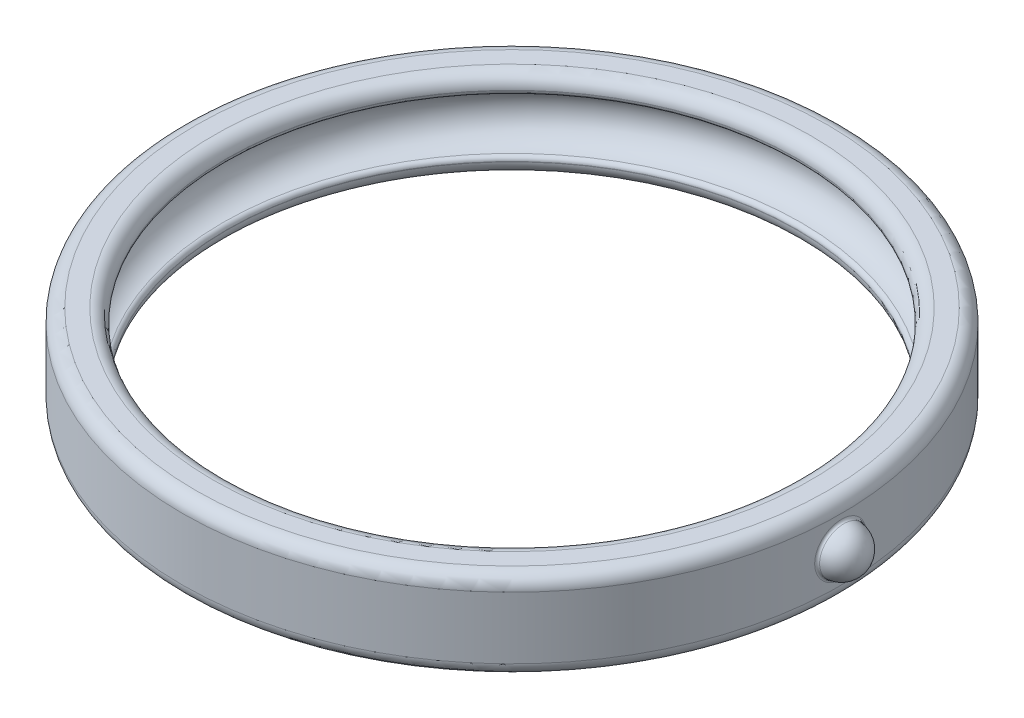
ISO-10303-21;
HEADER;
FILE_DESCRIPTION(('STEP AP214'),'2;1');
FILE_NAME('part.step','',(''),(''),'','','');
FILE_SCHEMA(('AUTOMOTIVE_DESIGN { 1 0 10303 214 1 1 1 1 }'));
ENDSEC;
DATA;
#1=APPLICATION_CONTEXT('core data for automotive mechanical design processes');
#2=APPLICATION_PROTOCOL_DEFINITION('international standard','automotive_design',2000,#1);
#3=PRODUCT_CONTEXT('',#1,'mechanical');
#4=PRODUCT('Part','Part','',(#3));
#5=PRODUCT_RELATED_PRODUCT_CATEGORY('part','',(#4));
#6=PRODUCT_DEFINITION_FORMATION('','',#4);
#7=PRODUCT_DEFINITION_CONTEXT('part definition',#1,'design');
#8=PRODUCT_DEFINITION('design','',#6,#7);
#9=PRODUCT_DEFINITION_SHAPE('','',#8);
#10=(LENGTH_UNIT() NAMED_UNIT(*) SI_UNIT(.MILLI.,.METRE.));
#11=(NAMED_UNIT(*) PLANE_ANGLE_UNIT() SI_UNIT($,.RADIAN.));
#12=(NAMED_UNIT(*) SI_UNIT($,.STERADIAN.) SOLID_ANGLE_UNIT());
#13=UNCERTAINTY_MEASURE_WITH_UNIT(LENGTH_MEASURE(1.E-05),#10,'distance_accuracy_value','');
#14=(GEOMETRIC_REPRESENTATION_CONTEXT(3) GLOBAL_UNCERTAINTY_ASSIGNED_CONTEXT((#13)) GLOBAL_UNIT_ASSIGNED_CONTEXT((#10,
#11,#12)) REPRESENTATION_CONTEXT('',''));
#15=CARTESIAN_POINT('',(0.,0.,0.));
#16=DIRECTION('',(0.,0.,1.));
#17=DIRECTION('',(1.,0.,0.));
#18=AXIS2_PLACEMENT_3D('',#15,#16,#17);
#19=CARTESIAN_POINT('',(0.,8.5,0.));
#20=DIRECTION('',(0.,-1.,0.));
#21=DIRECTION('',(0.,0.,-1.));
#22=AXIS2_PLACEMENT_3D('',#19,#20,#21);
#23=TOROIDAL_SURFACE('',#22,33.7,1.5);
#24=CARTESIAN_POINT('',(0.,8.5,0.));
#25=DIRECTION('',(0.,-1.,0.));
#26=DIRECTION('',(0.,0.,-1.));
#27=AXIS2_PLACEMENT_3D('',#24,#25,#26);
#28=CIRCLE('',#27,32.2);
#29=CARTESIAN_POINT('',(0.,8.5,-32.2));
#30=VERTEX_POINT('',#29);
#31=EDGE_CURVE('E150',#30,#30,#28,.T.);
#32=ORIENTED_EDGE('',*,*,#31,.T.);
#33=EDGE_LOOP('',(#32));
#34=FACE_BOUND('',#33,.T.);
#35=CARTESIAN_POINT('',(0.,10.,0.));
#36=DIRECTION('',(0.,-1.,0.));
#37=DIRECTION('',(0.,0.,-1.));
#38=AXIS2_PLACEMENT_3D('',#35,#36,#37);
#39=CIRCLE('',#38,33.7);
#40=CARTESIAN_POINT('',(0.,10.,-33.7));
#41=VERTEX_POINT('',#40);
#42=EDGE_CURVE('E117',#41,#41,#39,.T.);
#43=ORIENTED_EDGE('',*,*,#42,.F.);
#44=EDGE_LOOP('',(#43));
#45=FACE_BOUND('',#44,.T.);
#46=ADVANCED_FACE('F34',(#34,#45),#23,.T.);
#47=CARTESIAN_POINT('',(33.7,10.,0.));
#48=DIRECTION('',(0.,1.,0.));
#49=DIRECTION('',(0.,0.,1.));
#50=AXIS2_PLACEMENT_3D('',#47,#48,#49);
#51=PLANE('',#50);
#52=ORIENTED_EDGE('',*,*,#42,.T.);
#53=EDGE_LOOP('',(#52));
#54=FACE_BOUND('',#53,.T.);
#55=CARTESIAN_POINT('',(0.,10.,0.));
#56=DIRECTION('',(0.,-1.,0.));
#57=DIRECTION('',(0.,0.,-1.));
#58=AXIS2_PLACEMENT_3D('',#55,#56,#57);
#59=CIRCLE('',#58,35.7);
#60=CARTESIAN_POINT('',(0.,10.,-35.7));
#61=VERTEX_POINT('',#60);
#62=EDGE_CURVE('E120',#61,#61,#59,.T.);
#63=ORIENTED_EDGE('',*,*,#62,.F.);
#64=EDGE_LOOP('',(#63));
#65=FACE_BOUND('',#64,.T.);
#66=ADVANCED_FACE('F169',(#54,#65),#51,.T.);
#67=CARTESIAN_POINT('',(0.,8.5,0.));
#68=DIRECTION('',(0.,-1.,0.));
#69=DIRECTION('',(0.,0.,-1.));
#70=AXIS2_PLACEMENT_3D('',#67,#68,#69);
#71=TOROIDAL_SURFACE('',#70,35.7,1.5);
#72=ORIENTED_EDGE('',*,*,#62,.T.);
#73=EDGE_LOOP('',(#72));
#74=FACE_BOUND('',#73,.T.);
#75=CARTESIAN_POINT('',(0.,8.5,0.));
#76=DIRECTION('',(0.,-1.,0.));
#77=DIRECTION('',(0.,0.,-1.));
#78=AXIS2_PLACEMENT_3D('',#75,#76,#77);
#79=CIRCLE('',#78,37.2);
#80=CARTESIAN_POINT('',(0.,8.5,-37.2));
#81=VERTEX_POINT('',#80);
#82=EDGE_CURVE('E123',#81,#81,#79,.T.);
#83=ORIENTED_EDGE('',*,*,#82,.F.);
#84=EDGE_LOOP('',(#83));
#85=FACE_BOUND('',#84,.T.);
#86=ADVANCED_FACE('F91',(#74,#85),#71,.T.);
#87=CARTESIAN_POINT('',(0.,0.,0.));
#88=DIRECTION('',(0.,-1.,0.));
#89=DIRECTION('',(0.,0.,-1.));
#90=AXIS2_PLACEMENT_3D('',#87,#88,#89);
#91=CYLINDRICAL_SURFACE('',#90,37.2);
#92=CARTESIAN_POINT('',(37.0851666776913,4.99909068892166,-2.92068698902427));
#93=CARTESIAN_POINT('',(37.1056115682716,4.99917176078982,-2.66108978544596));
#94=CARTESIAN_POINT('',(37.3655042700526,4.99918316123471,-2.64482658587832));
#95=CARTESIAN_POINT('',(37.0851706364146,4.83476292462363,-2.92063653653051));
#96=CARTESIAN_POINT('',(37.1056148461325,4.84949578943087,-2.6610434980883));
#97=CARTESIAN_POINT('',(37.3655078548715,4.85156669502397,-2.64478089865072));
#98=CARTESIAN_POINT('',(37.0862650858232,4.67044059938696,-2.90683766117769));
#99=CARTESIAN_POINT('',(37.10652216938,4.69977643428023,-2.64836958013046));
#100=CARTESIAN_POINT('',(37.3664989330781,4.70395511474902,-2.63228533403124));
#101=CARTESIAN_POINT('',(37.0905112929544,4.3464740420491,-2.85214194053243));
#102=CARTESIAN_POINT('',(37.1100377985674,4.40477844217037,-2.59818811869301));
#103=CARTESIAN_POINT('',(37.370344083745,4.41293430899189,-2.58275565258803));
#104=CARTESIAN_POINT('',(37.0936630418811,4.18682978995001,-2.81124521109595));
#105=CARTESIAN_POINT('',(37.1126482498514,4.25941218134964,-2.5606496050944));
#106=CARTESIAN_POINT('',(37.37319814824,4.2695250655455,-2.54572164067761));
#107=CARTESIAN_POINT('',(37.101668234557,3.87675820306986,-2.70353645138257));
#108=CARTESIAN_POINT('',(37.1192681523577,3.97729666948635,-2.46191359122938));
#109=CARTESIAN_POINT('',(37.3804472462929,3.99098618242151,-2.44818602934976));
#110=CARTESIAN_POINT('',(37.1065214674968,3.72632972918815,-2.63672763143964));
#111=CARTESIAN_POINT('',(37.1232807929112,3.84048461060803,-2.40066552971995));
#112=CARTESIAN_POINT('',(37.3848420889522,3.85585551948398,-2.38768733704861));
#113=CARTESIAN_POINT('',(37.117384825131,3.43889622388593,-2.47910413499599));
#114=CARTESIAN_POINT('',(37.1322474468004,3.5792982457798,-2.25636233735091));
#115=CARTESIAN_POINT('',(37.3946793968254,3.59765254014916,-2.24495146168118));
#116=CARTESIAN_POINT('',(37.1233949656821,3.30189137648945,-2.3882891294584));
#117=CARTESIAN_POINT('',(37.1372045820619,3.45489852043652,-2.17324602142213));
#118=CARTESIAN_POINT('',(37.4001218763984,3.4745803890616,-2.16271398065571));
#119=CARTESIAN_POINT('',(37.1359184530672,3.0447522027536,-2.1849340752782));
#120=CARTESIAN_POINT('',(37.1475171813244,3.22161352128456,-1.987382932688));
#121=CARTESIAN_POINT('',(37.4114625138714,3.24359096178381,-1.97856591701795));
#122=CARTESIAN_POINT('',(37.1424332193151,2.9246683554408,-2.07233130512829));
#123=CARTESIAN_POINT('',(37.1528752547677,3.11278761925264,-1.88452901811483));
#124=CARTESIAN_POINT('',(37.4173619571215,3.13571903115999,-1.87659853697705));
#125=CARTESIAN_POINT('',(37.1552210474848,2.70518976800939,-1.82876731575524));
#126=CARTESIAN_POINT('',(37.1633780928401,2.91402248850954,-1.66232276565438));
#127=CARTESIAN_POINT('',(37.4289419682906,2.9385603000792,-1.65603929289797));
#128=CARTESIAN_POINT('',(37.1614941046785,2.60579543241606,-1.69780573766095));
#129=CARTESIAN_POINT('',(37.1685220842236,2.82412700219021,-1.54294560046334));
#130=CARTESIAN_POINT('',(37.4346225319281,2.84927386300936,-1.5374471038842));
#131=CARTESIAN_POINT('',(37.1731192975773,2.43013258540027,-1.42072763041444));
#132=CARTESIAN_POINT('',(37.1780456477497,2.66531887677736,-1.29061715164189));
#133=CARTESIAN_POINT('',(37.4451497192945,2.6914750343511,-1.28653916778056));
#134=CARTESIAN_POINT('',(37.1784680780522,2.35394759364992,-1.27455884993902));
#135=CARTESIAN_POINT('',(37.1824196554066,2.59654308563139,-1.1576323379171));
#136=CARTESIAN_POINT('',(37.4499933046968,2.62303766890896,-1.15417610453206));
#137=CARTESIAN_POINT('',(37.1876182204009,2.2272938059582,-0.971595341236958));
#138=CARTESIAN_POINT('',(37.1898989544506,2.48221515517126,-0.882161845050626));
#139=CARTESIAN_POINT('',(37.4582792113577,2.50926392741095,-0.879827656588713));
#140=CARTESIAN_POINT('',(37.1914195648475,2.17682529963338,-0.814800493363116));
#141=CARTESIAN_POINT('',(37.1930006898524,2.436722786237,-0.73972765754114));
#142=CARTESIAN_POINT('',(37.4617215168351,2.4639278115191,-0.737842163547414));
#143=CARTESIAN_POINT('',(37.1970557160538,2.1029218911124,-0.494682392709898));
#144=CARTESIAN_POINT('',(37.197600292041,2.37008435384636,-0.448986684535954));
#145=CARTESIAN_POINT('',(37.4668253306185,2.39754000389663,-0.447959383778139));
#146=CARTESIAN_POINT('',(37.1988864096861,2.07954352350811,-0.331346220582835));
#147=CARTESIAN_POINT('',(37.1990920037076,2.34903074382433,-0.300752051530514));
#148=CARTESIAN_POINT('',(37.468483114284,2.37653909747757,-0.300050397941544));
#149=CARTESIAN_POINT('',(37.200361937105,2.06065681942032,-0.0030867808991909));
#150=CARTESIAN_POINT('',(37.2002952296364,2.33200970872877,-0.00278027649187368));
#151=CARTESIAN_POINT('',(37.4698192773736,2.35957307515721,-0.00279523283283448));
#152=CARTESIAN_POINT('',(37.2000067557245,2.06514867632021,0.161836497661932));
#153=CARTESIAN_POINT('',(37.2000059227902,2.33605387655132,0.146857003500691));
#154=CARTESIAN_POINT('',(37.4694976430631,2.36360813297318,0.146550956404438));
#155=CARTESIAN_POINT('',(37.1971491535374,2.10189440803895,0.488696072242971));
#156=CARTESIAN_POINT('',(37.1976753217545,2.36917323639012,0.443589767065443));
#157=CARTESIAN_POINT('',(37.4669099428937,2.39661701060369,0.442538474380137));
#158=CARTESIAN_POINT('',(37.1946454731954,2.1341645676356,0.650630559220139));
#159=CARTESIAN_POINT('',(37.1956345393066,2.39824117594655,0.590586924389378));
#160=CARTESIAN_POINT('',(37.4646427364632,2.42560545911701,0.589178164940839));
#161=CARTESIAN_POINT('',(37.1877714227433,2.22557529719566,0.966792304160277));
#162=CARTESIAN_POINT('',(37.1900222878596,2.48069002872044,0.877821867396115));
#163=CARTESIAN_POINT('',(37.4584179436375,2.50772018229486,0.875478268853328));
#164=CARTESIAN_POINT('',(37.1834010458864,2.28471596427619,1.12101953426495));
#165=CARTESIAN_POINT('',(37.1864540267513,2.53402189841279,1.01798481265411));
#166=CARTESIAN_POINT('',(37.4544603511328,2.56084654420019,1.01513865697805));
#167=CARTESIAN_POINT('',(37.1732815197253,2.42828253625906,1.41743626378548));
#168=CARTESIAN_POINT('',(37.1781767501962,2.66367643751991,1.28763022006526));
#169=CARTESIAN_POINT('',(37.4452966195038,2.68981312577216,1.28355867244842));
#170=CARTESIAN_POINT('',(37.1675326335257,2.51270361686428,1.55962805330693));
#171=CARTESIAN_POINT('',(37.1734714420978,2.73993215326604,1.41707487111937));
#172=CARTESIAN_POINT('',(37.4400907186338,2.76564901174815,1.41232037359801));
#173=CARTESIAN_POINT('',(37.15837189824,2.65635475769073,1.76066373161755));
#174=CARTESIAN_POINT('',(37.1659573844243,2.86993074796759,1.60034063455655));
#175=CARTESIAN_POINT('',(37.4317952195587,2.89469156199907,1.59436812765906));
#176=CARTESIAN_POINT('',(37.1552281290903,2.70708587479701,1.82564436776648));
#177=CARTESIAN_POINT('',(37.1633783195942,2.91583520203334,1.65957982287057));
#178=CARTESIAN_POINT('',(37.4289483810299,2.94026358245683,1.65321130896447));
#179=CARTESIAN_POINT('',(37.1488465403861,2.81394097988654,1.95119127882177));
#180=CARTESIAN_POINT('',(37.1581393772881,3.01257576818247,1.77408259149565));
#181=CARTESIAN_POINT('',(37.4231695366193,3.03625206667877,1.76690024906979));
#182=CARTESIAN_POINT('',(37.1456086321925,2.87007017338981,2.01175319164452));
#183=CARTESIAN_POINT('',(37.1554795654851,3.06341068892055,1.82934470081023));
#184=CARTESIAN_POINT('',(37.4202374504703,3.08667320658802,1.82174205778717));
#185=CARTESIAN_POINT('',(37.1359095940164,3.04567881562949,2.18579311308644));
#186=CARTESIAN_POINT('',(37.1475102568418,3.22246563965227,1.98814667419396));
#187=CARTESIAN_POINT('',(37.4114544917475,3.24442334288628,1.97934381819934));
#188=CARTESIAN_POINT('',(37.1294455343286,3.17264399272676,2.2919949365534));
#189=CARTESIAN_POINT('',(37.1421887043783,3.33760342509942,2.08521970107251));
#190=CARTESIAN_POINT('',(37.4056009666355,3.3584768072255,2.07551482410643));
#191=CARTESIAN_POINT('',(37.1172542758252,3.44283661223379,2.48163756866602));
#192=CARTESIAN_POINT('',(37.1321412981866,3.58287116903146,2.25865088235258));
#193=CARTESIAN_POINT('',(37.3945611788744,3.60119221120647,2.24724561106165));
#194=CARTESIAN_POINT('',(37.1115270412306,3.58606326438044,2.56507948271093));
#195=CARTESIAN_POINT('',(37.1274131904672,3.71300069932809,2.33506753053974));
#196=CARTESIAN_POINT('',(37.3893748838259,3.72985344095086,2.32280639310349));
#197=CARTESIAN_POINT('',(37.1039820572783,3.80973288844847,2.67128400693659));
#198=CARTESIAN_POINT('',(37.1211787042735,3.91641950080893,2.43238328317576));
#199=CARTESIAN_POINT('',(37.3825425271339,3.93077700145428,2.41897984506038));
#200=CARTESIAN_POINT('',(37.1016424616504,3.88571294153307,2.70351216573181));
#201=CARTESIAN_POINT('',(37.1192449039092,3.98552186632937,2.46191797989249));
#202=CARTESIAN_POINT('',(37.3804239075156,3.99903026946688,2.44816403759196));
#203=CARTESIAN_POINT('',(37.0973731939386,4.0400767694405,2.76147417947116));
#204=CARTESIAN_POINT('',(37.1157151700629,4.12594600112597,2.51504344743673));
#205=CARTESIAN_POINT('',(37.3765578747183,4.13769608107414,2.50065150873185));
#206=CARTESIAN_POINT('',(37.0954431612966,4.11845835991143,2.78721375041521));
#207=CARTESIAN_POINT('',(37.114118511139,4.19727283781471,2.53864644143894));
#208=CARTESIAN_POINT('',(37.3748101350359,4.20810666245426,2.52395996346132));
#209=CARTESIAN_POINT('',(37.0903568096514,4.35638313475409,2.85438775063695));
#210=CARTESIAN_POINT('',(37.1099112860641,4.413768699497,2.60023005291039));
#211=CARTESIAN_POINT('',(37.3702041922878,4.42183569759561,2.5847893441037));
#212=CARTESIAN_POINT('',(37.0878957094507,4.51895085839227,2.88589333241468));
#213=CARTESIAN_POINT('',(37.107872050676,4.56183931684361,2.62915678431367));
#214=CARTESIAN_POINT('',(37.3679755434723,4.56787111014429,2.61331920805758));
#215=CARTESIAN_POINT('',(37.0856177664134,4.78795243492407,2.91496794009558));
#216=CARTESIAN_POINT('',(37.105985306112,4.80684457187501,2.65584001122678));
#217=CARTESIAN_POINT('',(37.3659127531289,4.80951659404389,2.63964770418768));
#218=CARTESIAN_POINT('',(37.0851688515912,4.89358834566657,2.92065936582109));
#219=CARTESIAN_POINT('',(37.1056133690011,4.90307535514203,2.66106443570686));
#220=CARTESIAN_POINT('',(37.3655062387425,4.90440986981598,2.6448015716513));
#221=CARTESIAN_POINT('',(37.085164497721,5.1048631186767,2.92071468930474));
#222=CARTESIAN_POINT('',(37.1056097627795,5.09551411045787,2.66111520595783));
#223=CARTESIAN_POINT('',(37.3655022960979,5.0941990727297,2.64485166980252));
#224=CARTESIAN_POINT('',(37.0856090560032,5.21050198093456,2.91507862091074));
#225=CARTESIAN_POINT('',(37.105978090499,5.19174763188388,2.65594159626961));
#226=CARTESIAN_POINT('',(37.3659048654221,5.18909499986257,2.63974793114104));
#227=CARTESIAN_POINT('',(37.0878723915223,5.47908502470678,2.88619200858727));
#228=CARTESIAN_POINT('',(37.1078527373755,5.43637176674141,2.62943090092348));
#229=CARTESIAN_POINT('',(37.3679544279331,5.43036451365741,2.61358967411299));
#230=CARTESIAN_POINT('',(37.0903176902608,5.64124206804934,2.85489161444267));
#231=CARTESIAN_POINT('',(37.1098788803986,5.58406852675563,2.60069258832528));
#232=CARTESIAN_POINT('',(37.3701687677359,5.5760310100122,2.58524561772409));
#233=CARTESIAN_POINT('',(37.0953745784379,5.87860177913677,2.78812535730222));
#234=CARTESIAN_POINT('',(37.1140617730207,5.80005163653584,2.53948236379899));
#235=CARTESIAN_POINT('',(37.3747480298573,5.78925244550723,2.52478546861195));
#236=CARTESIAN_POINT('',(37.0972937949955,5.9568027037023,2.76253884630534));
#237=CARTESIAN_POINT('',(37.1156494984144,5.87121453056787,2.51601958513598));
#238=CARTESIAN_POINT('',(37.3764859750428,5.85950073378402,2.50161561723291));
#239=CARTESIAN_POINT('',(37.1015401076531,6.11082525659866,2.70491462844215));
#240=CARTESIAN_POINT('',(37.1191602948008,6.01132933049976,2.46320329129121));
#241=CARTESIAN_POINT('',(37.3803312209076,5.9978599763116,2.44943403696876));
#242=CARTESIAN_POINT('',(37.1038675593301,6.1866447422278,2.67287129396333));
#243=CARTESIAN_POINT('',(37.1210840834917,6.08028631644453,2.43383770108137));
#244=CARTESIAN_POINT('',(37.3824388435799,6.06596900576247,2.42041721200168));
#245=CARTESIAN_POINT('',(37.1113588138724,6.40938619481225,2.56749479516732));
#246=CARTESIAN_POINT('',(37.1272742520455,6.28286245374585,2.33727994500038));
#247=CARTESIAN_POINT('',(37.389222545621,6.26605878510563,2.32499357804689));
#248=CARTESIAN_POINT('',(37.117038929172,6.55191990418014,2.48482225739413));
#249=CARTESIAN_POINT('',(37.1319635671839,6.41236477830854,2.261566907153));
#250=CARTESIAN_POINT('',(37.3943661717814,6.39409754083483,2.25012950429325));
#251=CARTESIAN_POINT('',(37.1291371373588,6.82097351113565,2.29694932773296));
#252=CARTESIAN_POINT('',(37.141934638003,6.65660436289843,2.08974988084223));
#253=CARTESIAN_POINT('',(37.4053216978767,6.6357897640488,2.08000127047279));
#254=CARTESIAN_POINT('',(37.1355552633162,6.9474926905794,2.19174792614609));
#255=CARTESIAN_POINT('',(37.147218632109,6.771341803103,1.99358831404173));
#256=CARTESIAN_POINT('',(37.4111336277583,6.74944258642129,1.98473619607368));
#257=CARTESIAN_POINT('',(37.1452000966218,7.12272254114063,2.01926852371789));
#258=CARTESIAN_POINT('',(37.1551438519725,6.93005996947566,1.83620380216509));
#259=CARTESIAN_POINT('',(37.4198675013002,6.90685245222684,1.82854756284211));
#260=CARTESIAN_POINT('',(37.1484241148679,7.17880014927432,1.95920119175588));
#261=CARTESIAN_POINT('',(37.1577924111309,6.98085024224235,1.78139075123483));
#262=CARTESIAN_POINT('',(37.4227870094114,6.95722725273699,1.77415362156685));
#263=CARTESIAN_POINT('',(37.1547829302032,7.28562106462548,1.83466528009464));
#264=CARTESIAN_POINT('',(37.1630129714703,7.07756380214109,1.66780527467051));
#265=CARTESIAN_POINT('',(37.4285452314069,7.05318502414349,1.66138019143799));
#266=CARTESIAN_POINT('',(37.157917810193,7.33636945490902,1.77020099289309));
#267=CARTESIAN_POINT('',(37.1655849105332,7.12348593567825,1.60903419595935));
#268=CARTESIAN_POINT('',(37.4313840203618,7.0987725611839,1.60300458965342));
#269=CARTESIAN_POINT('',(37.1670611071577,7.48018103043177,1.57073656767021));
#270=CARTESIAN_POINT('',(37.1730851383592,7.2536352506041,1.42719275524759));
#271=CARTESIAN_POINT('',(37.4396637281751,7.22795923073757,1.42237968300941));
#272=CARTESIAN_POINT('',(37.1728105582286,7.56485204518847,1.42962400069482));
#273=CARTESIAN_POINT('',(37.1777912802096,7.33012098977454,1.29872385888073));
#274=CARTESIAN_POINT('',(37.4448701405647,7.30401963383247,1.29459527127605));
#275=CARTESIAN_POINT('',(37.1829771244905,7.70943963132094,1.13491071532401));
#276=CARTESIAN_POINT('',(37.186107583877,7.46070360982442,1.03061535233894));
#277=CARTESIAN_POINT('',(37.4540764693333,7.43390339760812,1.02771780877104));
#278=CARTESIAN_POINT('',(37.1873899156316,7.76927609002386,0.981271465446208));
#279=CARTESIAN_POINT('',(37.1897107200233,7.51466545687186,0.890980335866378));
#280=CARTESIAN_POINT('',(37.4580724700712,7.48765479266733,0.888589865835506));
#281=CARTESIAN_POINT('',(37.1943681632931,7.86221677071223,0.666170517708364));
#282=CARTESIAN_POINT('',(37.1954083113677,7.59849696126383,0.60469960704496));
#283=CARTESIAN_POINT('',(37.4643916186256,7.57114387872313,0.603250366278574));
#284=CARTESIAN_POINT('',(37.1969336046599,7.89532077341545,0.504708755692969));
#285=CARTESIAN_POINT('',(37.1974995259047,7.62831689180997,0.458127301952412));
#286=CARTESIAN_POINT('',(37.4667147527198,7.60088137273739,0.457038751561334));
#287=CARTESIAN_POINT('',(37.1999311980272,7.93389190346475,0.178304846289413));
#288=CARTESIAN_POINT('',(37.1999443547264,7.66308203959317,0.161803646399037));
#289=CARTESIAN_POINT('',(37.4694292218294,7.63553001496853,0.161463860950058));
#290=CARTESIAN_POINT('',(37.2003601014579,7.93931694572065,0.0133577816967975));
#291=CARTESIAN_POINT('',(37.2002937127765,7.66796640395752,0.0121441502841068));
#292=CARTESIAN_POINT('',(37.4698176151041,7.64040335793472,0.0120961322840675));
#293=CARTESIAN_POINT('',(37.1990279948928,7.92227110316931,-0.31510417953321));
#294=CARTESIAN_POINT('',(37.1992074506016,7.65260448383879,-0.286009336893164));
#295=CARTESIAN_POINT('',(37.4686113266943,7.6250909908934,-0.285342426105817));
#296=CARTESIAN_POINT('',(37.1972669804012,7.8998001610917,-0.478619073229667));
#297=CARTESIAN_POINT('',(37.1977725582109,7.63236846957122,-0.434403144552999));
#298=CARTESIAN_POINT('',(37.4670166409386,7.60490522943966,-0.433413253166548));
#299=CARTESIAN_POINT('',(37.1917516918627,7.82757278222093,-0.799622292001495));
#300=CARTESIAN_POINT('',(37.1932717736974,7.56724314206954,-0.725939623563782));
#301=CARTESIAN_POINT('',(37.4620222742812,7.54002300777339,-0.724097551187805));
#302=CARTESIAN_POINT('',(37.1879968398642,7.77780843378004,-0.957108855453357));
#303=CARTESIAN_POINT('',(37.1902081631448,7.52238742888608,-0.86899624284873));
#304=CARTESIAN_POINT('',(37.4586220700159,7.49531944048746,-0.866709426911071));
#305=CARTESIAN_POINT('',(37.1789154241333,7.65237016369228,-1.2615304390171));
#306=CARTESIAN_POINT('',(37.1827854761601,7.40916124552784,-1.14578104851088));
#307=CARTESIAN_POINT('',(37.4503983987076,7.38263760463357,-1.14237823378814));
#308=CARTESIAN_POINT('',(37.1735888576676,7.57669619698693,-1.40846544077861));
#309=CARTESIAN_POINT('',(37.1784299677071,7.34085040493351,-1.27945608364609));
#310=CARTESIAN_POINT('',(37.4455749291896,7.31465929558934,-1.27543514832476));
#311=CARTESIAN_POINT('',(37.1619666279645,7.40158893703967,-1.68753046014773));
#312=CARTESIAN_POINT('',(37.1689094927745,7.1825521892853,-1.53358133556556));
#313=CARTESIAN_POINT('',(37.4350504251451,7.157359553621,-1.52814233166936));
#314=CARTESIAN_POINT('',(37.1556714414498,7.30216731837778,-1.81966770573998));
#315=CARTESIAN_POINT('',(37.1637477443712,7.09263685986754,-1.65402423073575));
#316=CARTESIAN_POINT('',(37.4293498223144,7.06804860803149,-1.64779914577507));
#317=CARTESIAN_POINT('',(37.142820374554,7.08232494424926,-2.06544668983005));
#318=CARTESIAN_POINT('',(37.1531935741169,6.89355003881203,-1.87824216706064));
#319=CARTESIAN_POINT('',(37.4177125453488,6.87056308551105,-1.87036417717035));
#320=CARTESIAN_POINT('',(37.1362644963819,6.96190436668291,-2.17908858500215));
#321=CARTESIAN_POINT('',(37.1478019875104,6.78442338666,-1.9820415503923));
#322=CARTESIAN_POINT('',(37.4117758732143,6.76238866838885,-1.97327253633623));
#323=CARTESIAN_POINT('',(37.1236468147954,6.70370565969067,-2.38441576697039));
#324=CARTESIAN_POINT('',(37.1374122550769,6.55018379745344,-2.16970159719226));
#325=CARTESIAN_POINT('',(37.4003499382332,6.53044745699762,-2.15920645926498));
#326=CARTESIAN_POINT('',(37.1175840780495,6.56596163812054,-2.47614319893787));
#327=CARTESIAN_POINT('',(37.1324118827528,6.42511577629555,-2.25365157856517));
#328=CARTESIAN_POINT('',(37.3948598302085,6.40671130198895,-2.24227018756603));
#329=CARTESIAN_POINT('',(37.1066256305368,6.27682859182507,-2.63528450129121));
#330=CARTESIAN_POINT('',(37.1233669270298,6.16238863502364,-2.39934221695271));
#331=CARTESIAN_POINT('',(37.3849364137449,6.14698161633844,-2.38638051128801));
#332=CARTESIAN_POINT('',(37.1017298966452,6.12543983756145,-2.70269885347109));
#333=CARTESIAN_POINT('',(37.1193191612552,6.02470401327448,-2.46114543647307));
#334=CARTESIAN_POINT('',(37.3805030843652,6.01098832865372,-2.44742754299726));
#335=CARTESIAN_POINT('',(37.0936765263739,5.81388063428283,-2.8110716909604));
#336=CARTESIAN_POINT('',(37.1126594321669,5.74123520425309,-2.56049014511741));
#337=CARTESIAN_POINT('',(37.373210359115,5.73111311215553,-2.54556450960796));
#338=CARTESIAN_POINT('',(37.0905128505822,5.65374286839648,-2.85212219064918));
#339=CARTESIAN_POINT('',(37.1100390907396,5.59541937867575,-2.59816996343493));
#340=CARTESIAN_POINT('',(37.3703454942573,5.58726054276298,-2.58273776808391));
#341=CARTESIAN_POINT('',(37.0862559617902,5.32876507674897,-2.90695486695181));
#342=CARTESIAN_POINT('',(37.1065146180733,5.29950048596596,-2.64847706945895));
#343=CARTESIAN_POINT('',(37.3664906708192,5.29533134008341,-2.63239146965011));
#344=CARTESIAN_POINT('',(37.0851627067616,5.16392514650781,-2.92073759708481));
#345=CARTESIAN_POINT('',(37.1056082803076,5.14930907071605,-2.66113621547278));
#346=CARTESIAN_POINT('',(37.3655006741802,5.1472547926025,-2.64487241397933));
#347=CARTESIAN_POINT('',(37.0851666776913,4.99909068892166,-2.92068698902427));
#348=CARTESIAN_POINT('',(37.1056115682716,4.99917176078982,-2.66108978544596));
#349=CARTESIAN_POINT('',(37.3655042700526,4.99918316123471,-2.64482658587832));
#350=(BOUNDED_SURFACE() B_SPLINE_SURFACE(3,2,((#92,#93,#94),(#95,#96,#97),(#98,#99,#100),(#101,
#102,#103),(#104,#105,#106),(#107,#108,#109),(#110,#111,#112),(#113,#114,#115),(#116,#117,#118),
(#119,#120,#121),(#122,#123,#124),(#125,#126,#127),(#128,#129,#130),(#131,#132,#133),(#134,#135,
#136),(#137,#138,#139),(#140,#141,#142),(#143,#144,#145),(#146,#147,#148),(#149,#150,#151),
(#152,#153,#154),(#155,#156,#157),(#158,#159,#160),(#161,#162,#163),(#164,#165,#166),(#167,#168,
#169),(#170,#171,#172),(#173,#174,#175),(#176,#177,#178),(#179,#180,#181),(#182,#183,#184),
(#185,#186,#187),(#188,#189,#190),(#191,#192,#193),(#194,#195,#196),(#197,#198,#199),(#200,#201,
#202),(#203,#204,#205),(#206,#207,#208),(#209,#210,#211),(#212,#213,#214),(#215,#216,#217),
(#218,#219,#220),(#221,#222,#223),(#224,#225,#226),(#227,#228,#229),(#230,#231,#232),(#233,#234,
#235),(#236,#237,#238),(#239,#240,#241),(#242,#243,#244),(#245,#246,#247),(#248,#249,#250),
(#251,#252,#253),(#254,#255,#256),(#257,#258,#259),(#260,#261,#262),(#263,#264,#265),(#266,#267,
#268),(#269,#270,#271),(#272,#273,#274),(#275,#276,#277),(#278,#279,#280),(#281,#282,#283),
(#284,#285,#286),(#287,#288,#289),(#290,#291,#292),(#293,#294,#295),(#296,#297,#298),(#299,#300,
#301),(#302,#303,#304),(#305,#306,#307),(#308,#309,#310),(#311,#312,#313),(#314,#315,#316),
(#317,#318,#319),(#320,#321,#322),(#323,#324,#325),(#326,#327,#328),(#329,#330,#331),(#332,#333,
#334),(#335,#336,#337),(#338,#339,#340),(#341,#342,#343),(#344,#345,#346),(#347,#348,#349)),
.UNSPECIFIED.,.T.,.F.,.F.) B_SPLINE_SURFACE_WITH_KNOTS((4,2,2,2,2,2,2,2,2,2,2,2,2,2,2,2,2,2,2,2,
2,2,2,2,2,2,2,2,2,2,2,2,2,2,2,2,2,2,2,2,2,2,4),(3,3),(0.,0.492398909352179,0.984795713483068,
1.47713153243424,1.96947409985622,2.46325567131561,2.9570468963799,3.45259461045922,
3.94814790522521,4.44473352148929,4.94132258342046,5.43820296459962,5.93508514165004,
6.43187255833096,6.68035701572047,6.92908354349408,7.42518214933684,7.92125665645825,
8.1689976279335,8.41651958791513,8.91076018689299,9.22758382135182,9.5444065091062,
10.0373411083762,10.2842045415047,10.531284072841,11.0244306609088,11.5175993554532,
11.7651246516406,12.0124116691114,12.5068125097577,13.0027960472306,13.4987836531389,
13.995525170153,14.4922677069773,14.9891543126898,15.4860417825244,15.9826854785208,
16.4793249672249,16.9750015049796,17.470668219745,17.9645954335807,18.458512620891),(0.,1.),
.UNSPECIFIED.) GEOMETRIC_REPRESENTATION_ITEM() RATIONAL_B_SPLINE_SURFACE(((1.,0.755189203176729,
1.),(1.,0.755188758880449,1.),(1.,0.75506597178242,1.),(1.,0.754589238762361,1.),(1.,
0.754235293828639,1.),(1.,0.753335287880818,1.),(1.,0.752789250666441,1.),(1.,0.751565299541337,
1.),(1.,0.750887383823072,1.),(1.,0.749472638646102,1.),(1.,0.748735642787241,1.),(1.,
0.747286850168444,1.),(1.,0.746575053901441,1.),(1.,0.745254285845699,1.),(1.,0.74464568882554,
1.),(1.,0.743603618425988,1.),(1.,0.743170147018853,1.),(1.,0.742527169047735,1.),(1.,
0.742318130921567,1.),(1.,0.742149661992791,1.),(1.,0.742190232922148,1.),(1.,0.742516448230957,
1.),(1.,0.742802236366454,1.),(1.,0.743586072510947,1.),(1.,0.744084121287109,1.),(1.,
0.745235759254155,1.),(1.,0.745889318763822,1.),(1.,0.746929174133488,1.),(1.,0.747285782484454,
1.),(1.,0.748009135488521,1.),(1.,0.748375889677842,1.),(1.,0.749473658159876,1.),(1.,
0.750204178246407,1.),(1.,0.751580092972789,1.),(1.,0.752225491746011,1.),(1.,0.753074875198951,
1.),(1.,0.753338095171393,1.),(1.,0.753818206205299,1.),(1.,0.754035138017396,1.),(1.,
0.754606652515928,1.),(1.,0.754882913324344,1.),(1.,0.755138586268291,1.),(1.,0.755188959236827,
1.),(1.,0.755189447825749,1.),(1.,0.755139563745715,1.),(1.,0.754885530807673,1.),(1.,
0.754611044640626,1.),(1.,0.754042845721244,1.),(1.,0.753827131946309,1.),(1.,0.753349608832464,
1.),(1.,0.753087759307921,1.),(1.,0.75224444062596,1.),(1.,0.751604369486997,1.),(1.,
0.750239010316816,1.),(1.,0.749513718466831,1.),(1.,0.748422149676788,1.),(1.,0.748056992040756,
1.),(1.,0.747336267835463,1.),(1.,0.746980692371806,1.),(1.,0.74594288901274,1.),(1.,
0.745289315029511,1.),(1.,0.744132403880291,1.),(1.,0.743629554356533,1.),(1.,0.74283387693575,
1.),(1.,0.742541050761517,1.),(1.,0.742198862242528,1.),(1.,0.742149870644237,1.),(1.,
0.742301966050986,1.),(1.,0.742503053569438,1.),(1.,0.743132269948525,1.),(1.,0.74356046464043,
1.),(1.,0.744594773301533,1.),(1.,0.745200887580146,1.),(1.,0.746521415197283,1.),(1.,
0.747235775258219,1.),(1.,0.748691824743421,1.),(1.,0.749433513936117,1.),(1.,0.750858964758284,
1.),(1.,0.751542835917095,1.),(1.,0.752777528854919,1.),(1.,0.753328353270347,1.),(1.,
0.75423377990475,1.),(1.,0.754589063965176,1.),(1.,0.755066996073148,1.),(1.,0.755189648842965,
1.),(1.,0.755189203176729,1.))) REPRESENTATION_ITEM('') SURFACE());
#351=CARTESIAN_POINT('',(37.0851666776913,4.99909068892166,-2.92068698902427));
#352=CARTESIAN_POINT('',(37.0851706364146,4.83476292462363,-2.92063653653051));
#353=CARTESIAN_POINT('',(37.0862650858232,4.67044059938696,-2.90683766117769));
#354=CARTESIAN_POINT('',(37.0905112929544,4.3464740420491,-2.85214194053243));
#355=CARTESIAN_POINT('',(37.0936630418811,4.18682978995,-2.81124521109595));
#356=CARTESIAN_POINT('',(37.101668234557,3.87675820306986,-2.70353645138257));
#357=CARTESIAN_POINT('',(37.1065214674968,3.72632972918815,-2.63672763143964));
#358=CARTESIAN_POINT('',(37.117384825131,3.43889622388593,-2.47910413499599));
#359=CARTESIAN_POINT('',(37.1233949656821,3.30189137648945,-2.3882891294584));
#360=CARTESIAN_POINT('',(37.1359184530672,3.0447522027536,-2.1849340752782));
#361=CARTESIAN_POINT('',(37.1424332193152,2.9246683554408,-2.07233130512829));
#362=CARTESIAN_POINT('',(37.1552210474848,2.70518976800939,-1.82876731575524));
#363=CARTESIAN_POINT('',(37.1614941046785,2.60579543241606,-1.69780573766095));
#364=CARTESIAN_POINT('',(37.1731192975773,2.43013258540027,-1.42072763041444));
#365=CARTESIAN_POINT('',(37.1784680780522,2.35394759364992,-1.27455884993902));
#366=CARTESIAN_POINT('',(37.1876182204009,2.2272938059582,-0.971595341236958));
#367=CARTESIAN_POINT('',(37.1914195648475,2.17682529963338,-0.814800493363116));
#368=CARTESIAN_POINT('',(37.1970557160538,2.1029218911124,-0.494682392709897));
#369=CARTESIAN_POINT('',(37.1988864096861,2.07954352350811,-0.331346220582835));
#370=CARTESIAN_POINT('',(37.200361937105,2.06065681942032,-0.00308678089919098));
#371=CARTESIAN_POINT('',(37.2000067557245,2.06514867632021,0.161836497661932));
#372=CARTESIAN_POINT('',(37.1971491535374,2.10189440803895,0.488696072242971));
#373=CARTESIAN_POINT('',(37.1946454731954,2.1341645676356,0.650630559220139));
#374=CARTESIAN_POINT('',(37.1877714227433,2.22557529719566,0.966792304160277));
#375=CARTESIAN_POINT('',(37.1834010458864,2.28471596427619,1.12101953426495));
#376=CARTESIAN_POINT('',(37.1732815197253,2.42828253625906,1.41743626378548));
#377=CARTESIAN_POINT('',(37.1675326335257,2.51270361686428,1.55962805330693));
#378=CARTESIAN_POINT('',(37.15837189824,2.65635475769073,1.76066373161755));
#379=CARTESIAN_POINT('',(37.1552281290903,2.70708587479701,1.82564436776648));
#380=CARTESIAN_POINT('',(37.1488465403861,2.81394097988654,1.95119127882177));
#381=CARTESIAN_POINT('',(37.1456086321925,2.87007017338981,2.01175319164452));
#382=CARTESIAN_POINT('',(37.1359095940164,3.04567881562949,2.18579311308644));
#383=CARTESIAN_POINT('',(37.1294455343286,3.17264399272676,2.2919949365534));
#384=CARTESIAN_POINT('',(37.1172542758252,3.44283661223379,2.48163756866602));
#385=CARTESIAN_POINT('',(37.1115270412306,3.58606326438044,2.56507948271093));
#386=CARTESIAN_POINT('',(37.1039820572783,3.80973288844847,2.67128400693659));
#387=CARTESIAN_POINT('',(37.1016424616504,3.88571294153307,2.70351216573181));
#388=CARTESIAN_POINT('',(37.0973731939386,4.0400767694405,2.76147417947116));
#389=CARTESIAN_POINT('',(37.0954431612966,4.11845835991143,2.78721375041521));
#390=CARTESIAN_POINT('',(37.0903568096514,4.35638313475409,2.85438775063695));
#391=CARTESIAN_POINT('',(37.0878957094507,4.51895085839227,2.88589333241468));
#392=CARTESIAN_POINT('',(37.0856177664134,4.78795243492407,2.91496794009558));
#393=CARTESIAN_POINT('',(37.0851688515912,4.89358834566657,2.92065936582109));
#394=CARTESIAN_POINT('',(37.085164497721,5.1048631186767,2.92071468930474));
#395=CARTESIAN_POINT('',(37.0856090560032,5.21050198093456,2.91507862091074));
#396=CARTESIAN_POINT('',(37.0878723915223,5.47908502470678,2.88619200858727));
#397=CARTESIAN_POINT('',(37.0903176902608,5.64124206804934,2.85489161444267));
#398=CARTESIAN_POINT('',(37.0953745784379,5.87860177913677,2.78812535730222));
#399=CARTESIAN_POINT('',(37.0972937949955,5.9568027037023,2.76253884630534));
#400=CARTESIAN_POINT('',(37.1015401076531,6.11082525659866,2.70491462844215));
#401=CARTESIAN_POINT('',(37.1038675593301,6.1866447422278,2.67287129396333));
#402=CARTESIAN_POINT('',(37.1113588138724,6.40938619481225,2.56749479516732));
#403=CARTESIAN_POINT('',(37.117038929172,6.55191990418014,2.48482225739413));
#404=CARTESIAN_POINT('',(37.1291371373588,6.82097351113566,2.29694932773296));
#405=CARTESIAN_POINT('',(37.1355552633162,6.9474926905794,2.19174792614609));
#406=CARTESIAN_POINT('',(37.1452000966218,7.12272254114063,2.01926852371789));
#407=CARTESIAN_POINT('',(37.1484241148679,7.17880014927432,1.95920119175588));
#408=CARTESIAN_POINT('',(37.1547829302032,7.28562106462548,1.83466528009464));
#409=CARTESIAN_POINT('',(37.157917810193,7.33636945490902,1.77020099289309));
#410=CARTESIAN_POINT('',(37.1670611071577,7.48018103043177,1.57073656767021));
#411=CARTESIAN_POINT('',(37.1728105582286,7.56485204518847,1.42962400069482));
#412=CARTESIAN_POINT('',(37.1829771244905,7.70943963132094,1.13491071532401));
#413=CARTESIAN_POINT('',(37.1873899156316,7.76927609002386,0.981271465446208));
#414=CARTESIAN_POINT('',(37.1943681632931,7.86221677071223,0.666170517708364));
#415=CARTESIAN_POINT('',(37.1969336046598,7.89532077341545,0.504708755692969));
#416=CARTESIAN_POINT('',(37.1999311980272,7.93389190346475,0.178304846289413));
#417=CARTESIAN_POINT('',(37.2003601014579,7.93931694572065,0.0133577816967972));
#418=CARTESIAN_POINT('',(37.1990279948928,7.92227110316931,-0.31510417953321));
#419=CARTESIAN_POINT('',(37.1972669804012,7.8998001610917,-0.478619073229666));
#420=CARTESIAN_POINT('',(37.1917516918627,7.82757278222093,-0.799622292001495));
#421=CARTESIAN_POINT('',(37.1879968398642,7.77780843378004,-0.957108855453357));
#422=CARTESIAN_POINT('',(37.1789154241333,7.65237016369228,-1.2615304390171));
#423=CARTESIAN_POINT('',(37.1735888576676,7.57669619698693,-1.40846544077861));
#424=CARTESIAN_POINT('',(37.1619666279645,7.40158893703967,-1.68753046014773));
#425=CARTESIAN_POINT('',(37.1556714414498,7.30216731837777,-1.81966770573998));
#426=CARTESIAN_POINT('',(37.142820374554,7.08232494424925,-2.06544668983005));
#427=CARTESIAN_POINT('',(37.1362644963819,6.96190436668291,-2.17908858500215));
#428=CARTESIAN_POINT('',(37.1236468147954,6.70370565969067,-2.38441576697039));
#429=CARTESIAN_POINT('',(37.1175840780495,6.56596163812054,-2.47614319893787));
#430=CARTESIAN_POINT('',(37.1066256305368,6.27682859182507,-2.63528450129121));
#431=CARTESIAN_POINT('',(37.1017298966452,6.12543983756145,-2.70269885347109));
#432=CARTESIAN_POINT('',(37.0936765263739,5.81388063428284,-2.8110716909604));
#433=CARTESIAN_POINT('',(37.0905128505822,5.65374286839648,-2.85212219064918));
#434=CARTESIAN_POINT('',(37.0862559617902,5.32876507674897,-2.90695486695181));
#435=CARTESIAN_POINT('',(37.0851627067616,5.16392514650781,-2.92073759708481));
#436=CARTESIAN_POINT('',(37.0851666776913,4.99909068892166,-2.92068698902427));
#437=B_SPLINE_CURVE_WITH_KNOTS('',3,(#351,#352,#353,#354,#355,#356,#357,#358,#359,#360,#361,
#362,#363,#364,#365,#366,#367,#368,#369,#370,#371,#372,#373,#374,#375,#376,#377,#378,#379,#380,
#381,#382,#383,#384,#385,#386,#387,#388,#389,#390,#391,#392,#393,#394,#395,#396,#397,#398,#399,
#400,#401,#402,#403,#404,#405,#406,#407,#408,#409,#410,#411,#412,#413,#414,#415,#416,#417,#418,
#419,#420,#421,#422,#423,#424,#425,#426,#427,#428,#429,#430,#431,#432,#433,#434,#435,#436),
.UNSPECIFIED.,.T.,.F.,(4,2,2,2,2,2,2,2,2,2,2,2,2,2,2,2,2,2,2,2,2,2,2,2,2,2,2,2,2,2,2,2,2,2,2,2,
2,2,2,2,2,2,4),(0.,0.492398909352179,0.984795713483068,1.47713153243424,1.96947409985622,
2.46325567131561,2.9570468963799,3.45259461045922,3.94814790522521,4.44473352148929,
4.94132258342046,5.43820296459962,5.93508514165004,6.43187255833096,6.68035701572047,
6.92908354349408,7.42518214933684,7.92125665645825,8.1689976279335,8.41651958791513,
8.91076018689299,9.22758382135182,9.5444065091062,10.0373411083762,10.2842045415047,
10.531284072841,11.0244306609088,11.5175993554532,11.7651246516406,12.0124116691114,
12.5068125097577,13.0027960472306,13.4987836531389,13.995525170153,14.4922677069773,
14.9891543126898,15.4860417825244,15.9826854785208,16.4793249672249,16.9750015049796,
17.470668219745,17.9645954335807,18.458512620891),.UNSPECIFIED.);
#438=CARTESIAN_POINT('',(37.0851666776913,4.99909068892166,-2.92068698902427));
#439=VERTEX_POINT('',#438);
#440=EDGE_CURVE('E44',#439,#439,#437,.T.);
#441=ORIENTED_EDGE('',*,*,#440,.T.);
#442=EDGE_LOOP('',(#441));
#443=FACE_BOUND('',#442,.T.);
#444=CARTESIAN_POINT('',(-37.0851666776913,4.99909068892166,2.92068698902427));
#445=CARTESIAN_POINT('',(-37.1056115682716,4.99917176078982,2.66108978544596));
#446=CARTESIAN_POINT('',(-37.3655042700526,4.99918316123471,2.64482658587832));
#447=CARTESIAN_POINT('',(-37.0851706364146,4.83476292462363,2.92063653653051));
#448=CARTESIAN_POINT('',(-37.1056148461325,4.84949578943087,2.6610434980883));
#449=CARTESIAN_POINT('',(-37.3655078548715,4.85156669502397,2.64478089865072));
#450=CARTESIAN_POINT('',(-37.0862650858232,4.67044059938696,2.90683766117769));
#451=CARTESIAN_POINT('',(-37.10652216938,4.69977643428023,2.64836958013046));
#452=CARTESIAN_POINT('',(-37.3664989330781,4.70395511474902,2.63228533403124));
#453=CARTESIAN_POINT('',(-37.0905112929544,4.3464740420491,2.85214194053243));
#454=CARTESIAN_POINT('',(-37.1100377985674,4.40477844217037,2.59818811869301));
#455=CARTESIAN_POINT('',(-37.370344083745,4.41293430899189,2.58275565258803));
#456=CARTESIAN_POINT('',(-37.0936630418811,4.18682978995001,2.81124521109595));
#457=CARTESIAN_POINT('',(-37.1126482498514,4.25941218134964,2.5606496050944));
#458=CARTESIAN_POINT('',(-37.37319814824,4.2695250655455,2.54572164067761));
#459=CARTESIAN_POINT('',(-37.101668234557,3.87675820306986,2.70353645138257));
#460=CARTESIAN_POINT('',(-37.1192681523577,3.97729666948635,2.46191359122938));
#461=CARTESIAN_POINT('',(-37.3804472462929,3.99098618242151,2.44818602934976));
#462=CARTESIAN_POINT('',(-37.1065214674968,3.72632972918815,2.63672763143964));
#463=CARTESIAN_POINT('',(-37.1232807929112,3.84048461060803,2.40066552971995));
#464=CARTESIAN_POINT('',(-37.3848420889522,3.85585551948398,2.38768733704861));
#465=CARTESIAN_POINT('',(-37.117384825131,3.43889622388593,2.47910413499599));
#466=CARTESIAN_POINT('',(-37.1322474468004,3.5792982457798,2.25636233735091));
#467=CARTESIAN_POINT('',(-37.3946793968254,3.59765254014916,2.24495146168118));
#468=CARTESIAN_POINT('',(-37.1233949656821,3.30189137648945,2.3882891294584));
#469=CARTESIAN_POINT('',(-37.1372045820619,3.45489852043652,2.17324602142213));
#470=CARTESIAN_POINT('',(-37.4001218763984,3.4745803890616,2.16271398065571));
#471=CARTESIAN_POINT('',(-37.1359184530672,3.0447522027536,2.1849340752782));
#472=CARTESIAN_POINT('',(-37.1475171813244,3.22161352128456,1.987382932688));
#473=CARTESIAN_POINT('',(-37.4114625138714,3.24359096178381,1.97856591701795));
#474=CARTESIAN_POINT('',(-37.1424332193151,2.9246683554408,2.07233130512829));
#475=CARTESIAN_POINT('',(-37.1528752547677,3.11278761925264,1.88452901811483));
#476=CARTESIAN_POINT('',(-37.4173619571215,3.13571903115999,1.87659853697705));
#477=CARTESIAN_POINT('',(-37.1552210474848,2.70518976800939,1.82876731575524));
#478=CARTESIAN_POINT('',(-37.1633780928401,2.91402248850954,1.66232276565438));
#479=CARTESIAN_POINT('',(-37.4289419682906,2.9385603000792,1.65603929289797));
#480=CARTESIAN_POINT('',(-37.1614941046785,2.60579543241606,1.69780573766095));
#481=CARTESIAN_POINT('',(-37.1685220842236,2.82412700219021,1.54294560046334));
#482=CARTESIAN_POINT('',(-37.4346225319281,2.84927386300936,1.5374471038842));
#483=CARTESIAN_POINT('',(-37.1731192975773,2.43013258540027,1.42072763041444));
#484=CARTESIAN_POINT('',(-37.1780456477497,2.66531887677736,1.29061715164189));
#485=CARTESIAN_POINT('',(-37.4451497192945,2.6914750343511,1.28653916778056));
#486=CARTESIAN_POINT('',(-37.1784680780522,2.35394759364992,1.27455884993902));
#487=CARTESIAN_POINT('',(-37.1824196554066,2.59654308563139,1.1576323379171));
#488=CARTESIAN_POINT('',(-37.4499933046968,2.62303766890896,1.15417610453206));
#489=CARTESIAN_POINT('',(-37.1876182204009,2.2272938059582,0.971595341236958));
#490=CARTESIAN_POINT('',(-37.1898989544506,2.48221515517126,0.882161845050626));
#491=CARTESIAN_POINT('',(-37.4582792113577,2.50926392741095,0.879827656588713));
#492=CARTESIAN_POINT('',(-37.1914195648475,2.17682529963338,0.814800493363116));
#493=CARTESIAN_POINT('',(-37.1930006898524,2.436722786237,0.73972765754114));
#494=CARTESIAN_POINT('',(-37.4617215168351,2.4639278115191,0.737842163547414));
#495=CARTESIAN_POINT('',(-37.1970557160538,2.1029218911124,0.494682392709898));
#496=CARTESIAN_POINT('',(-37.197600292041,2.37008435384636,0.448986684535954));
#497=CARTESIAN_POINT('',(-37.4668253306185,2.39754000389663,0.447959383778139));
#498=CARTESIAN_POINT('',(-37.1988864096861,2.07954352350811,0.331346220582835));
#499=CARTESIAN_POINT('',(-37.1990920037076,2.34903074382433,0.300752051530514));
#500=CARTESIAN_POINT('',(-37.468483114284,2.37653909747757,0.300050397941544));
#501=CARTESIAN_POINT('',(-37.200361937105,2.06065681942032,0.0030867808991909));
#502=CARTESIAN_POINT('',(-37.2002952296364,2.33200970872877,0.00278027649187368));
#503=CARTESIAN_POINT('',(-37.4698192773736,2.35957307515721,0.00279523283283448));
#504=CARTESIAN_POINT('',(-37.2000067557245,2.06514867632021,-0.161836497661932));
#505=CARTESIAN_POINT('',(-37.2000059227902,2.33605387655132,-0.146857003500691));
#506=CARTESIAN_POINT('',(-37.4694976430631,2.36360813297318,-0.146550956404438));
#507=CARTESIAN_POINT('',(-37.1971491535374,2.10189440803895,-0.488696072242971));
#508=CARTESIAN_POINT('',(-37.1976753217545,2.36917323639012,-0.443589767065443));
#509=CARTESIAN_POINT('',(-37.4669099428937,2.39661701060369,-0.442538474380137));
#510=CARTESIAN_POINT('',(-37.1946454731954,2.1341645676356,-0.650630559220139));
#511=CARTESIAN_POINT('',(-37.1956345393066,2.39824117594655,-0.590586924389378));
#512=CARTESIAN_POINT('',(-37.4646427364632,2.42560545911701,-0.589178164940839));
#513=CARTESIAN_POINT('',(-37.1877714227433,2.22557529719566,-0.966792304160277));
#514=CARTESIAN_POINT('',(-37.1900222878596,2.48069002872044,-0.877821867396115));
#515=CARTESIAN_POINT('',(-37.4584179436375,2.50772018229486,-0.875478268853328));
#516=CARTESIAN_POINT('',(-37.1834010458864,2.28471596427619,-1.12101953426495));
#517=CARTESIAN_POINT('',(-37.1864540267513,2.53402189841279,-1.01798481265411));
#518=CARTESIAN_POINT('',(-37.4544603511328,2.56084654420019,-1.01513865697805));
#519=CARTESIAN_POINT('',(-37.1732815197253,2.42828253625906,-1.41743626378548));
#520=CARTESIAN_POINT('',(-37.1781767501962,2.66367643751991,-1.28763022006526));
#521=CARTESIAN_POINT('',(-37.4452966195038,2.68981312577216,-1.28355867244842));
#522=CARTESIAN_POINT('',(-37.1675326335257,2.51270361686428,-1.55962805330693));
#523=CARTESIAN_POINT('',(-37.1734714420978,2.73993215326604,-1.41707487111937));
#524=CARTESIAN_POINT('',(-37.4400907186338,2.76564901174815,-1.41232037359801));
#525=CARTESIAN_POINT('',(-37.15837189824,2.65635475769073,-1.76066373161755));
#526=CARTESIAN_POINT('',(-37.1659573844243,2.86993074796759,-1.60034063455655));
#527=CARTESIAN_POINT('',(-37.4317952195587,2.89469156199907,-1.59436812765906));
#528=CARTESIAN_POINT('',(-37.1552281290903,2.70708587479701,-1.82564436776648));
#529=CARTESIAN_POINT('',(-37.1633783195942,2.91583520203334,-1.65957982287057));
#530=CARTESIAN_POINT('',(-37.4289483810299,2.94026358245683,-1.65321130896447));
#531=CARTESIAN_POINT('',(-37.1488465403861,2.81394097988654,-1.95119127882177));
#532=CARTESIAN_POINT('',(-37.1581393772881,3.01257576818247,-1.77408259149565));
#533=CARTESIAN_POINT('',(-37.4231695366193,3.03625206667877,-1.76690024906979));
#534=CARTESIAN_POINT('',(-37.1456086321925,2.87007017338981,-2.01175319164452));
#535=CARTESIAN_POINT('',(-37.1554795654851,3.06341068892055,-1.82934470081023));
#536=CARTESIAN_POINT('',(-37.4202374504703,3.08667320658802,-1.82174205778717));
#537=CARTESIAN_POINT('',(-37.1359095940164,3.04567881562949,-2.18579311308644));
#538=CARTESIAN_POINT('',(-37.1475102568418,3.22246563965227,-1.98814667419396));
#539=CARTESIAN_POINT('',(-37.4114544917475,3.24442334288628,-1.97934381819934));
#540=CARTESIAN_POINT('',(-37.1294455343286,3.17264399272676,-2.2919949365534));
#541=CARTESIAN_POINT('',(-37.1421887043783,3.33760342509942,-2.08521970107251));
#542=CARTESIAN_POINT('',(-37.4056009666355,3.3584768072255,-2.07551482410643));
#543=CARTESIAN_POINT('',(-37.1172542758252,3.44283661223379,-2.48163756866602));
#544=CARTESIAN_POINT('',(-37.1321412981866,3.58287116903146,-2.25865088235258));
#545=CARTESIAN_POINT('',(-37.3945611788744,3.60119221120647,-2.24724561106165));
#546=CARTESIAN_POINT('',(-37.1115270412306,3.58606326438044,-2.56507948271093));
#547=CARTESIAN_POINT('',(-37.1274131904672,3.71300069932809,-2.33506753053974));
#548=CARTESIAN_POINT('',(-37.3893748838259,3.72985344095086,-2.32280639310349));
#549=CARTESIAN_POINT('',(-37.1039820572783,3.80973288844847,-2.67128400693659));
#550=CARTESIAN_POINT('',(-37.1211787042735,3.91641950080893,-2.43238328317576));
#551=CARTESIAN_POINT('',(-37.3825425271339,3.93077700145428,-2.41897984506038));
#552=CARTESIAN_POINT('',(-37.1016424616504,3.88571294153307,-2.70351216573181));
#553=CARTESIAN_POINT('',(-37.1192449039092,3.98552186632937,-2.46191797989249));
#554=CARTESIAN_POINT('',(-37.3804239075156,3.99903026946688,-2.44816403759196));
#555=CARTESIAN_POINT('',(-37.0973731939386,4.0400767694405,-2.76147417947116));
#556=CARTESIAN_POINT('',(-37.1157151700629,4.12594600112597,-2.51504344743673));
#557=CARTESIAN_POINT('',(-37.3765578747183,4.13769608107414,-2.50065150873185));
#558=CARTESIAN_POINT('',(-37.0954431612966,4.11845835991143,-2.78721375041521));
#559=CARTESIAN_POINT('',(-37.114118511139,4.19727283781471,-2.53864644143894));
#560=CARTESIAN_POINT('',(-37.3748101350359,4.20810666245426,-2.52395996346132));
#561=CARTESIAN_POINT('',(-37.0903568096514,4.35638313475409,-2.85438775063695));
#562=CARTESIAN_POINT('',(-37.1099112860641,4.413768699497,-2.60023005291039));
#563=CARTESIAN_POINT('',(-37.3702041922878,4.42183569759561,-2.5847893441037));
#564=CARTESIAN_POINT('',(-37.0878957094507,4.51895085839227,-2.88589333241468));
#565=CARTESIAN_POINT('',(-37.107872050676,4.56183931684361,-2.62915678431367));
#566=CARTESIAN_POINT('',(-37.3679755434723,4.56787111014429,-2.61331920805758));
#567=CARTESIAN_POINT('',(-37.0856177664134,4.78795243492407,-2.91496794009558));
#568=CARTESIAN_POINT('',(-37.105985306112,4.80684457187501,-2.65584001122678));
#569=CARTESIAN_POINT('',(-37.3659127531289,4.80951659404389,-2.63964770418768));
#570=CARTESIAN_POINT('',(-37.0851688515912,4.89358834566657,-2.92065936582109));
#571=CARTESIAN_POINT('',(-37.1056133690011,4.90307535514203,-2.66106443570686));
#572=CARTESIAN_POINT('',(-37.3655062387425,4.90440986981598,-2.6448015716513));
#573=CARTESIAN_POINT('',(-37.085164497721,5.1048631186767,-2.92071468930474));
#574=CARTESIAN_POINT('',(-37.1056097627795,5.09551411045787,-2.66111520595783));
#575=CARTESIAN_POINT('',(-37.3655022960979,5.0941990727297,-2.64485166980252));
#576=CARTESIAN_POINT('',(-37.0856090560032,5.21050198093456,-2.91507862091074));
#577=CARTESIAN_POINT('',(-37.105978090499,5.19174763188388,-2.65594159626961));
#578=CARTESIAN_POINT('',(-37.3659048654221,5.18909499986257,-2.63974793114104));
#579=CARTESIAN_POINT('',(-37.0878723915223,5.47908502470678,-2.88619200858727));
#580=CARTESIAN_POINT('',(-37.1078527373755,5.43637176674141,-2.62943090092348));
#581=CARTESIAN_POINT('',(-37.3679544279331,5.43036451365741,-2.61358967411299));
#582=CARTESIAN_POINT('',(-37.0903176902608,5.64124206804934,-2.85489161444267));
#583=CARTESIAN_POINT('',(-37.1098788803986,5.58406852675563,-2.60069258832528));
#584=CARTESIAN_POINT('',(-37.3701687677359,5.5760310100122,-2.58524561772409));
#585=CARTESIAN_POINT('',(-37.0953745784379,5.87860177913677,-2.78812535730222));
#586=CARTESIAN_POINT('',(-37.1140617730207,5.80005163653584,-2.53948236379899));
#587=CARTESIAN_POINT('',(-37.3747480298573,5.78925244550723,-2.52478546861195));
#588=CARTESIAN_POINT('',(-37.0972937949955,5.9568027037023,-2.76253884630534));
#589=CARTESIAN_POINT('',(-37.1156494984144,5.87121453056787,-2.51601958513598));
#590=CARTESIAN_POINT('',(-37.3764859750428,5.85950073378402,-2.50161561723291));
#591=CARTESIAN_POINT('',(-37.1015401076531,6.11082525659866,-2.70491462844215));
#592=CARTESIAN_POINT('',(-37.1191602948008,6.01132933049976,-2.46320329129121));
#593=CARTESIAN_POINT('',(-37.3803312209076,5.9978599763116,-2.44943403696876));
#594=CARTESIAN_POINT('',(-37.1038675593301,6.1866447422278,-2.67287129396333));
#595=CARTESIAN_POINT('',(-37.1210840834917,6.08028631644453,-2.43383770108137));
#596=CARTESIAN_POINT('',(-37.3824388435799,6.06596900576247,-2.42041721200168));
#597=CARTESIAN_POINT('',(-37.1113588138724,6.40938619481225,-2.56749479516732));
#598=CARTESIAN_POINT('',(-37.1272742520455,6.28286245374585,-2.33727994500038));
#599=CARTESIAN_POINT('',(-37.389222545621,6.26605878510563,-2.32499357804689));
#600=CARTESIAN_POINT('',(-37.117038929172,6.55191990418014,-2.48482225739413));
#601=CARTESIAN_POINT('',(-37.1319635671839,6.41236477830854,-2.261566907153));
#602=CARTESIAN_POINT('',(-37.3943661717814,6.39409754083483,-2.25012950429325));
#603=CARTESIAN_POINT('',(-37.1291371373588,6.82097351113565,-2.29694932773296));
#604=CARTESIAN_POINT('',(-37.141934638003,6.65660436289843,-2.08974988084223));
#605=CARTESIAN_POINT('',(-37.4053216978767,6.6357897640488,-2.08000127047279));
#606=CARTESIAN_POINT('',(-37.1355552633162,6.9474926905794,-2.19174792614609));
#607=CARTESIAN_POINT('',(-37.147218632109,6.771341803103,-1.99358831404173));
#608=CARTESIAN_POINT('',(-37.4111336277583,6.74944258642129,-1.98473619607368));
#609=CARTESIAN_POINT('',(-37.1452000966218,7.12272254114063,-2.01926852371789));
#610=CARTESIAN_POINT('',(-37.1551438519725,6.93005996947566,-1.83620380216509));
#611=CARTESIAN_POINT('',(-37.4198675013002,6.90685245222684,-1.82854756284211));
#612=CARTESIAN_POINT('',(-37.1484241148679,7.17880014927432,-1.95920119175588));
#613=CARTESIAN_POINT('',(-37.1577924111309,6.98085024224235,-1.78139075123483));
#614=CARTESIAN_POINT('',(-37.4227870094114,6.95722725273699,-1.77415362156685));
#615=CARTESIAN_POINT('',(-37.1547829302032,7.28562106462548,-1.83466528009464));
#616=CARTESIAN_POINT('',(-37.1630129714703,7.07756380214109,-1.66780527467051));
#617=CARTESIAN_POINT('',(-37.4285452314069,7.05318502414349,-1.66138019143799));
#618=CARTESIAN_POINT('',(-37.157917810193,7.33636945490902,-1.77020099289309));
#619=CARTESIAN_POINT('',(-37.1655849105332,7.12348593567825,-1.60903419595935));
#620=CARTESIAN_POINT('',(-37.4313840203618,7.0987725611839,-1.60300458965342));
#621=CARTESIAN_POINT('',(-37.1670611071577,7.48018103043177,-1.57073656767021));
#622=CARTESIAN_POINT('',(-37.1730851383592,7.2536352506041,-1.42719275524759));
#623=CARTESIAN_POINT('',(-37.4396637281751,7.22795923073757,-1.42237968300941));
#624=CARTESIAN_POINT('',(-37.1728105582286,7.56485204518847,-1.42962400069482));
#625=CARTESIAN_POINT('',(-37.1777912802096,7.33012098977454,-1.29872385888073));
#626=CARTESIAN_POINT('',(-37.4448701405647,7.30401963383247,-1.29459527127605));
#627=CARTESIAN_POINT('',(-37.1829771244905,7.70943963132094,-1.13491071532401));
#628=CARTESIAN_POINT('',(-37.186107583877,7.46070360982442,-1.03061535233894));
#629=CARTESIAN_POINT('',(-37.4540764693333,7.43390339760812,-1.02771780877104));
#630=CARTESIAN_POINT('',(-37.1873899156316,7.76927609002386,-0.981271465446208));
#631=CARTESIAN_POINT('',(-37.1897107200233,7.51466545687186,-0.890980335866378));
#632=CARTESIAN_POINT('',(-37.4580724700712,7.48765479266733,-0.888589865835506));
#633=CARTESIAN_POINT('',(-37.1943681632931,7.86221677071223,-0.666170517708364));
#634=CARTESIAN_POINT('',(-37.1954083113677,7.59849696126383,-0.60469960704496));
#635=CARTESIAN_POINT('',(-37.4643916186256,7.57114387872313,-0.603250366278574));
#636=CARTESIAN_POINT('',(-37.1969336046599,7.89532077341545,-0.504708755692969));
#637=CARTESIAN_POINT('',(-37.1974995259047,7.62831689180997,-0.458127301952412));
#638=CARTESIAN_POINT('',(-37.4667147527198,7.60088137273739,-0.457038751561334));
#639=CARTESIAN_POINT('',(-37.1999311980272,7.93389190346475,-0.178304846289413));
#640=CARTESIAN_POINT('',(-37.1999443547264,7.66308203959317,-0.161803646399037));
#641=CARTESIAN_POINT('',(-37.4694292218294,7.63553001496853,-0.161463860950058));
#642=CARTESIAN_POINT('',(-37.2003601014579,7.93931694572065,-0.0133577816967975));
#643=CARTESIAN_POINT('',(-37.2002937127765,7.66796640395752,-0.0121441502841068));
#644=CARTESIAN_POINT('',(-37.4698176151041,7.64040335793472,-0.0120961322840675));
#645=CARTESIAN_POINT('',(-37.1990279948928,7.92227110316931,0.31510417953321));
#646=CARTESIAN_POINT('',(-37.1992074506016,7.65260448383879,0.286009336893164));
#647=CARTESIAN_POINT('',(-37.4686113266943,7.6250909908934,0.285342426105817));
#648=CARTESIAN_POINT('',(-37.1972669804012,7.8998001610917,0.478619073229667));
#649=CARTESIAN_POINT('',(-37.1977725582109,7.63236846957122,0.434403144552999));
#650=CARTESIAN_POINT('',(-37.4670166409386,7.60490522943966,0.433413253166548));
#651=CARTESIAN_POINT('',(-37.1917516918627,7.82757278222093,0.799622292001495));
#652=CARTESIAN_POINT('',(-37.1932717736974,7.56724314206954,0.725939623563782));
#653=CARTESIAN_POINT('',(-37.4620222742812,7.54002300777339,0.724097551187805));
#654=CARTESIAN_POINT('',(-37.1879968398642,7.77780843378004,0.957108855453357));
#655=CARTESIAN_POINT('',(-37.1902081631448,7.52238742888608,0.86899624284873));
#656=CARTESIAN_POINT('',(-37.4586220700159,7.49531944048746,0.866709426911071));
#657=CARTESIAN_POINT('',(-37.1789154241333,7.65237016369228,1.2615304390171));
#658=CARTESIAN_POINT('',(-37.1827854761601,7.40916124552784,1.14578104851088));
#659=CARTESIAN_POINT('',(-37.4503983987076,7.38263760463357,1.14237823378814));
#660=CARTESIAN_POINT('',(-37.1735888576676,7.57669619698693,1.40846544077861));
#661=CARTESIAN_POINT('',(-37.1784299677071,7.34085040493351,1.27945608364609));
#662=CARTESIAN_POINT('',(-37.4455749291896,7.31465929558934,1.27543514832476));
#663=CARTESIAN_POINT('',(-37.1619666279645,7.40158893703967,1.68753046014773));
#664=CARTESIAN_POINT('',(-37.1689094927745,7.1825521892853,1.53358133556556));
#665=CARTESIAN_POINT('',(-37.4350504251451,7.157359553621,1.52814233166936));
#666=CARTESIAN_POINT('',(-37.1556714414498,7.30216731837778,1.81966770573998));
#667=CARTESIAN_POINT('',(-37.1637477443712,7.09263685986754,1.65402423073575));
#668=CARTESIAN_POINT('',(-37.4293498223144,7.06804860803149,1.64779914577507));
#669=CARTESIAN_POINT('',(-37.142820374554,7.08232494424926,2.06544668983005));
#670=CARTESIAN_POINT('',(-37.1531935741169,6.89355003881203,1.87824216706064));
#671=CARTESIAN_POINT('',(-37.4177125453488,6.87056308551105,1.87036417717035));
#672=CARTESIAN_POINT('',(-37.1362644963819,6.96190436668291,2.17908858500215));
#673=CARTESIAN_POINT('',(-37.1478019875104,6.78442338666,1.9820415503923));
#674=CARTESIAN_POINT('',(-37.4117758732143,6.76238866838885,1.97327253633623));
#675=CARTESIAN_POINT('',(-37.1236468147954,6.70370565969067,2.38441576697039));
#676=CARTESIAN_POINT('',(-37.1374122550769,6.55018379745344,2.16970159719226));
#677=CARTESIAN_POINT('',(-37.4003499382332,6.53044745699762,2.15920645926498));
#678=CARTESIAN_POINT('',(-37.1175840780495,6.56596163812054,2.47614319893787));
#679=CARTESIAN_POINT('',(-37.1324118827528,6.42511577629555,2.25365157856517));
#680=CARTESIAN_POINT('',(-37.3948598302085,6.40671130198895,2.24227018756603));
#681=CARTESIAN_POINT('',(-37.1066256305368,6.27682859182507,2.63528450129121));
#682=CARTESIAN_POINT('',(-37.1233669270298,6.16238863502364,2.39934221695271));
#683=CARTESIAN_POINT('',(-37.3849364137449,6.14698161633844,2.38638051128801));
#684=CARTESIAN_POINT('',(-37.1017298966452,6.12543983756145,2.70269885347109));
#685=CARTESIAN_POINT('',(-37.1193191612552,6.02470401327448,2.46114543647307));
#686=CARTESIAN_POINT('',(-37.3805030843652,6.01098832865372,2.44742754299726));
#687=CARTESIAN_POINT('',(-37.0936765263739,5.81388063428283,2.8110716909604));
#688=CARTESIAN_POINT('',(-37.1126594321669,5.74123520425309,2.56049014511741));
#689=CARTESIAN_POINT('',(-37.373210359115,5.73111311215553,2.54556450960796));
#690=CARTESIAN_POINT('',(-37.0905128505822,5.65374286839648,2.85212219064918));
#691=CARTESIAN_POINT('',(-37.1100390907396,5.59541937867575,2.59816996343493));
#692=CARTESIAN_POINT('',(-37.3703454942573,5.58726054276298,2.58273776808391));
#693=CARTESIAN_POINT('',(-37.0862559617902,5.32876507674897,2.90695486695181));
#694=CARTESIAN_POINT('',(-37.1065146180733,5.29950048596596,2.64847706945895));
#695=CARTESIAN_POINT('',(-37.3664906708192,5.29533134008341,2.63239146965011));
#696=CARTESIAN_POINT('',(-37.0851627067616,5.16392514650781,2.92073759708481));
#697=CARTESIAN_POINT('',(-37.1056082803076,5.14930907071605,2.66113621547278));
#698=CARTESIAN_POINT('',(-37.3655006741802,5.1472547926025,2.64487241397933));
#699=CARTESIAN_POINT('',(-37.0851666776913,4.99909068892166,2.92068698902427));
#700=CARTESIAN_POINT('',(-37.1056115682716,4.99917176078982,2.66108978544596));
#701=CARTESIAN_POINT('',(-37.3655042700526,4.99918316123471,2.64482658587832));
#702=(BOUNDED_SURFACE() B_SPLINE_SURFACE(3,2,((#444,#445,#446),(#447,#448,#449),(#450,#451,
#452),(#453,#454,#455),(#456,#457,#458),(#459,#460,#461),(#462,#463,#464),(#465,#466,#467),
(#468,#469,#470),(#471,#472,#473),(#474,#475,#476),(#477,#478,#479),(#480,#481,#482),(#483,#484,
#485),(#486,#487,#488),(#489,#490,#491),(#492,#493,#494),(#495,#496,#497),(#498,#499,#500),
(#501,#502,#503),(#504,#505,#506),(#507,#508,#509),(#510,#511,#512),(#513,#514,#515),(#516,#517,
#518),(#519,#520,#521),(#522,#523,#524),(#525,#526,#527),(#528,#529,#530),(#531,#532,#533),
(#534,#535,#536),(#537,#538,#539),(#540,#541,#542),(#543,#544,#545),(#546,#547,#548),(#549,#550,
#551),(#552,#553,#554),(#555,#556,#557),(#558,#559,#560),(#561,#562,#563),(#564,#565,#566),
(#567,#568,#569),(#570,#571,#572),(#573,#574,#575),(#576,#577,#578),(#579,#580,#581),(#582,#583,
#584),(#585,#586,#587),(#588,#589,#590),(#591,#592,#593),(#594,#595,#596),(#597,#598,#599),
(#600,#601,#602),(#603,#604,#605),(#606,#607,#608),(#609,#610,#611),(#612,#613,#614),(#615,#616,
#617),(#618,#619,#620),(#621,#622,#623),(#624,#625,#626),(#627,#628,#629),(#630,#631,#632),
(#633,#634,#635),(#636,#637,#638),(#639,#640,#641),(#642,#643,#644),(#645,#646,#647),(#648,#649,
#650),(#651,#652,#653),(#654,#655,#656),(#657,#658,#659),(#660,#661,#662),(#663,#664,#665),
(#666,#667,#668),(#669,#670,#671),(#672,#673,#674),(#675,#676,#677),(#678,#679,#680),(#681,#682,
#683),(#684,#685,#686),(#687,#688,#689),(#690,#691,#692),(#693,#694,#695),(#696,#697,#698),
(#699,#700,#701)),.UNSPECIFIED.,.T.,.F.,.F.) B_SPLINE_SURFACE_WITH_KNOTS((4,2,2,2,2,2,2,2,2,2,2,
2,2,2,2,2,2,2,2,2,2,2,2,2,2,2,2,2,2,2,2,2,2,2,2,2,2,2,2,2,2,2,4),(3,3),(0.,0.492398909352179,
0.984795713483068,1.47713153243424,1.96947409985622,2.46325567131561,2.9570468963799,
3.45259461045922,3.94814790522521,4.44473352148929,4.94132258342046,5.43820296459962,
5.93508514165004,6.43187255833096,6.68035701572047,6.92908354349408,7.42518214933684,
7.92125665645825,8.1689976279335,8.41651958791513,8.91076018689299,9.22758382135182,
9.5444065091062,10.0373411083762,10.2842045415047,10.531284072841,11.0244306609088,
11.5175993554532,11.7651246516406,12.0124116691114,12.5068125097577,13.0027960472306,
13.4987836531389,13.995525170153,14.4922677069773,14.9891543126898,15.4860417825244,
15.9826854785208,16.4793249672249,16.9750015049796,17.470668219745,17.9645954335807,
18.458512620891),(0.,1.),
.UNSPECIFIED.) GEOMETRIC_REPRESENTATION_ITEM() RATIONAL_B_SPLINE_SURFACE(((1.,0.755189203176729,
1.),(1.,0.755188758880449,1.),(1.,0.75506597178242,1.),(1.,0.754589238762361,1.),(1.,
0.754235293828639,1.),(1.,0.753335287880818,1.),(1.,0.752789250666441,1.),(1.,0.751565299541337,
1.),(1.,0.750887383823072,1.),(1.,0.749472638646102,1.),(1.,0.748735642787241,1.),(1.,
0.747286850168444,1.),(1.,0.746575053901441,1.),(1.,0.745254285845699,1.),(1.,0.74464568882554,
1.),(1.,0.743603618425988,1.),(1.,0.743170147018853,1.),(1.,0.742527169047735,1.),(1.,
0.742318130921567,1.),(1.,0.742149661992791,1.),(1.,0.742190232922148,1.),(1.,0.742516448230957,
1.),(1.,0.742802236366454,1.),(1.,0.743586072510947,1.),(1.,0.744084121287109,1.),(1.,
0.745235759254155,1.),(1.,0.745889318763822,1.),(1.,0.746929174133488,1.),(1.,0.747285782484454,
1.),(1.,0.748009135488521,1.),(1.,0.748375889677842,1.),(1.,0.749473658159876,1.),(1.,
0.750204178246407,1.),(1.,0.751580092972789,1.),(1.,0.752225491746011,1.),(1.,0.753074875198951,
1.),(1.,0.753338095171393,1.),(1.,0.753818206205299,1.),(1.,0.754035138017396,1.),(1.,
0.754606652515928,1.),(1.,0.754882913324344,1.),(1.,0.755138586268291,1.),(1.,0.755188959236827,
1.),(1.,0.755189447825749,1.),(1.,0.755139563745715,1.),(1.,0.754885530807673,1.),(1.,
0.754611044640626,1.),(1.,0.754042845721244,1.),(1.,0.753827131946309,1.),(1.,0.753349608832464,
1.),(1.,0.753087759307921,1.),(1.,0.75224444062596,1.),(1.,0.751604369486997,1.),(1.,
0.750239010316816,1.),(1.,0.749513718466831,1.),(1.,0.748422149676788,1.),(1.,0.748056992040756,
1.),(1.,0.747336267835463,1.),(1.,0.746980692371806,1.),(1.,0.74594288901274,1.),(1.,
0.745289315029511,1.),(1.,0.744132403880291,1.),(1.,0.743629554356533,1.),(1.,0.74283387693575,
1.),(1.,0.742541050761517,1.),(1.,0.742198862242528,1.),(1.,0.742149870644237,1.),(1.,
0.742301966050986,1.),(1.,0.742503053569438,1.),(1.,0.743132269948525,1.),(1.,0.74356046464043,
1.),(1.,0.744594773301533,1.),(1.,0.745200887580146,1.),(1.,0.746521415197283,1.),(1.,
0.747235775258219,1.),(1.,0.748691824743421,1.),(1.,0.749433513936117,1.),(1.,0.750858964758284,
1.),(1.,0.751542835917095,1.),(1.,0.752777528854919,1.),(1.,0.753328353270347,1.),(1.,
0.75423377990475,1.),(1.,0.754589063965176,1.),(1.,0.755066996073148,1.),(1.,0.755189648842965,
1.),(1.,0.755189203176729,1.))) REPRESENTATION_ITEM('') SURFACE());
#703=CARTESIAN_POINT('',(-37.0851666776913,4.99909068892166,2.92068698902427));
#704=CARTESIAN_POINT('',(-37.0851706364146,4.83476292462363,2.92063653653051));
#705=CARTESIAN_POINT('',(-37.0862650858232,4.67044059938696,2.90683766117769));
#706=CARTESIAN_POINT('',(-37.0905112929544,4.3464740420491,2.85214194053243));
#707=CARTESIAN_POINT('',(-37.0936630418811,4.18682978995,2.81124521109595));
#708=CARTESIAN_POINT('',(-37.101668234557,3.87675820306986,2.70353645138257));
#709=CARTESIAN_POINT('',(-37.1065214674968,3.72632972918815,2.63672763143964));
#710=CARTESIAN_POINT('',(-37.117384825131,3.43889622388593,2.47910413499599));
#711=CARTESIAN_POINT('',(-37.1233949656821,3.30189137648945,2.3882891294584));
#712=CARTESIAN_POINT('',(-37.1359184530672,3.0447522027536,2.1849340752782));
#713=CARTESIAN_POINT('',(-37.1424332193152,2.9246683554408,2.07233130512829));
#714=CARTESIAN_POINT('',(-37.1552210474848,2.70518976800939,1.82876731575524));
#715=CARTESIAN_POINT('',(-37.1614941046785,2.60579543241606,1.69780573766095));
#716=CARTESIAN_POINT('',(-37.1731192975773,2.43013258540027,1.42072763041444));
#717=CARTESIAN_POINT('',(-37.1784680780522,2.35394759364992,1.27455884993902));
#718=CARTESIAN_POINT('',(-37.1876182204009,2.2272938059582,0.971595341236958));
#719=CARTESIAN_POINT('',(-37.1914195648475,2.17682529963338,0.814800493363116));
#720=CARTESIAN_POINT('',(-37.1970557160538,2.1029218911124,0.494682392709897));
#721=CARTESIAN_POINT('',(-37.1988864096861,2.07954352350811,0.331346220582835));
#722=CARTESIAN_POINT('',(-37.200361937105,2.06065681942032,0.00308678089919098));
#723=CARTESIAN_POINT('',(-37.2000067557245,2.06514867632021,-0.161836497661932));
#724=CARTESIAN_POINT('',(-37.1971491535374,2.10189440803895,-0.488696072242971));
#725=CARTESIAN_POINT('',(-37.1946454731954,2.1341645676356,-0.650630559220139));
#726=CARTESIAN_POINT('',(-37.1877714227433,2.22557529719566,-0.966792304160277));
#727=CARTESIAN_POINT('',(-37.1834010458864,2.28471596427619,-1.12101953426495));
#728=CARTESIAN_POINT('',(-37.1732815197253,2.42828253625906,-1.41743626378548));
#729=CARTESIAN_POINT('',(-37.1675326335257,2.51270361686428,-1.55962805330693));
#730=CARTESIAN_POINT('',(-37.15837189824,2.65635475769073,-1.76066373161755));
#731=CARTESIAN_POINT('',(-37.1552281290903,2.70708587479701,-1.82564436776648));
#732=CARTESIAN_POINT('',(-37.1488465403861,2.81394097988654,-1.95119127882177));
#733=CARTESIAN_POINT('',(-37.1456086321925,2.87007017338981,-2.01175319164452));
#734=CARTESIAN_POINT('',(-37.1359095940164,3.04567881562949,-2.18579311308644));
#735=CARTESIAN_POINT('',(-37.1294455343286,3.17264399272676,-2.2919949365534));
#736=CARTESIAN_POINT('',(-37.1172542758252,3.44283661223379,-2.48163756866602));
#737=CARTESIAN_POINT('',(-37.1115270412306,3.58606326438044,-2.56507948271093));
#738=CARTESIAN_POINT('',(-37.1039820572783,3.80973288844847,-2.67128400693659));
#739=CARTESIAN_POINT('',(-37.1016424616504,3.88571294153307,-2.70351216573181));
#740=CARTESIAN_POINT('',(-37.0973731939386,4.0400767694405,-2.76147417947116));
#741=CARTESIAN_POINT('',(-37.0954431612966,4.11845835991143,-2.78721375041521));
#742=CARTESIAN_POINT('',(-37.0903568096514,4.35638313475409,-2.85438775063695));
#743=CARTESIAN_POINT('',(-37.0878957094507,4.51895085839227,-2.88589333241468));
#744=CARTESIAN_POINT('',(-37.0856177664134,4.78795243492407,-2.91496794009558));
#745=CARTESIAN_POINT('',(-37.0851688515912,4.89358834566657,-2.92065936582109));
#746=CARTESIAN_POINT('',(-37.085164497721,5.1048631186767,-2.92071468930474));
#747=CARTESIAN_POINT('',(-37.0856090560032,5.21050198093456,-2.91507862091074));
#748=CARTESIAN_POINT('',(-37.0878723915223,5.47908502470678,-2.88619200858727));
#749=CARTESIAN_POINT('',(-37.0903176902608,5.64124206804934,-2.85489161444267));
#750=CARTESIAN_POINT('',(-37.0953745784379,5.87860177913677,-2.78812535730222));
#751=CARTESIAN_POINT('',(-37.0972937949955,5.9568027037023,-2.76253884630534));
#752=CARTESIAN_POINT('',(-37.1015401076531,6.11082525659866,-2.70491462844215));
#753=CARTESIAN_POINT('',(-37.1038675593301,6.1866447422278,-2.67287129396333));
#754=CARTESIAN_POINT('',(-37.1113588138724,6.40938619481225,-2.56749479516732));
#755=CARTESIAN_POINT('',(-37.117038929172,6.55191990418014,-2.48482225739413));
#756=CARTESIAN_POINT('',(-37.1291371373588,6.82097351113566,-2.29694932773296));
#757=CARTESIAN_POINT('',(-37.1355552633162,6.9474926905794,-2.19174792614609));
#758=CARTESIAN_POINT('',(-37.1452000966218,7.12272254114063,-2.01926852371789));
#759=CARTESIAN_POINT('',(-37.1484241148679,7.17880014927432,-1.95920119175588));
#760=CARTESIAN_POINT('',(-37.1547829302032,7.28562106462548,-1.83466528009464));
#761=CARTESIAN_POINT('',(-37.157917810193,7.33636945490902,-1.77020099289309));
#762=CARTESIAN_POINT('',(-37.1670611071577,7.48018103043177,-1.57073656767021));
#763=CARTESIAN_POINT('',(-37.1728105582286,7.56485204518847,-1.42962400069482));
#764=CARTESIAN_POINT('',(-37.1829771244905,7.70943963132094,-1.13491071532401));
#765=CARTESIAN_POINT('',(-37.1873899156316,7.76927609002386,-0.981271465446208));
#766=CARTESIAN_POINT('',(-37.1943681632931,7.86221677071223,-0.666170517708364));
#767=CARTESIAN_POINT('',(-37.1969336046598,7.89532077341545,-0.504708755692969));
#768=CARTESIAN_POINT('',(-37.1999311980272,7.93389190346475,-0.178304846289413));
#769=CARTESIAN_POINT('',(-37.2003601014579,7.93931694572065,-0.0133577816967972));
#770=CARTESIAN_POINT('',(-37.1990279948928,7.92227110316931,0.31510417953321));
#771=CARTESIAN_POINT('',(-37.1972669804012,7.8998001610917,0.478619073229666));
#772=CARTESIAN_POINT('',(-37.1917516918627,7.82757278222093,0.799622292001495));
#773=CARTESIAN_POINT('',(-37.1879968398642,7.77780843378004,0.957108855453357));
#774=CARTESIAN_POINT('',(-37.1789154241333,7.65237016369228,1.2615304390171));
#775=CARTESIAN_POINT('',(-37.1735888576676,7.57669619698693,1.40846544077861));
#776=CARTESIAN_POINT('',(-37.1619666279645,7.40158893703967,1.68753046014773));
#777=CARTESIAN_POINT('',(-37.1556714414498,7.30216731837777,1.81966770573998));
#778=CARTESIAN_POINT('',(-37.142820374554,7.08232494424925,2.06544668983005));
#779=CARTESIAN_POINT('',(-37.1362644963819,6.96190436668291,2.17908858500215));
#780=CARTESIAN_POINT('',(-37.1236468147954,6.70370565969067,2.38441576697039));
#781=CARTESIAN_POINT('',(-37.1175840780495,6.56596163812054,2.47614319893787));
#782=CARTESIAN_POINT('',(-37.1066256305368,6.27682859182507,2.63528450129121));
#783=CARTESIAN_POINT('',(-37.1017298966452,6.12543983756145,2.70269885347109));
#784=CARTESIAN_POINT('',(-37.0936765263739,5.81388063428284,2.8110716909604));
#785=CARTESIAN_POINT('',(-37.0905128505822,5.65374286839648,2.85212219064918));
#786=CARTESIAN_POINT('',(-37.0862559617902,5.32876507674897,2.90695486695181));
#787=CARTESIAN_POINT('',(-37.0851627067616,5.16392514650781,2.92073759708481));
#788=CARTESIAN_POINT('',(-37.0851666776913,4.99909068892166,2.92068698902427));
#789=B_SPLINE_CURVE_WITH_KNOTS('',3,(#703,#704,#705,#706,#707,#708,#709,#710,#711,#712,#713,
#714,#715,#716,#717,#718,#719,#720,#721,#722,#723,#724,#725,#726,#727,#728,#729,#730,#731,#732,
#733,#734,#735,#736,#737,#738,#739,#740,#741,#742,#743,#744,#745,#746,#747,#748,#749,#750,#751,
#752,#753,#754,#755,#756,#757,#758,#759,#760,#761,#762,#763,#764,#765,#766,#767,#768,#769,#770,
#771,#772,#773,#774,#775,#776,#777,#778,#779,#780,#781,#782,#783,#784,#785,#786,#787,#788),
.UNSPECIFIED.,.T.,.F.,(4,2,2,2,2,2,2,2,2,2,2,2,2,2,2,2,2,2,2,2,2,2,2,2,2,2,2,2,2,2,2,2,2,2,2,2,
2,2,2,2,2,2,4),(0.,0.492398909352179,0.984795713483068,1.47713153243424,1.96947409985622,
2.46325567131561,2.9570468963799,3.45259461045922,3.94814790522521,4.44473352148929,
4.94132258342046,5.43820296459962,5.93508514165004,6.43187255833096,6.68035701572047,
6.92908354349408,7.42518214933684,7.92125665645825,8.1689976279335,8.41651958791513,
8.91076018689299,9.22758382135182,9.5444065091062,10.0373411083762,10.2842045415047,
10.531284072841,11.0244306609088,11.5175993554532,11.7651246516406,12.0124116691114,
12.5068125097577,13.0027960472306,13.4987836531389,13.995525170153,14.4922677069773,
14.9891543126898,15.4860417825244,15.9826854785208,16.4793249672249,16.9750015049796,
17.470668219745,17.9645954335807,18.458512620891),.UNSPECIFIED.);
#790=CARTESIAN_POINT('',(-37.0851666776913,4.99909068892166,2.92068698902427));
#791=VERTEX_POINT('',#790);
#792=EDGE_CURVE('E49',#791,#791,#789,.T.);
#793=ORIENTED_EDGE('',*,*,#792,.T.);
#794=EDGE_LOOP('',(#793));
#795=FACE_BOUND('',#794,.T.);
#796=ORIENTED_EDGE('',*,*,#82,.T.);
#797=EDGE_LOOP('',(#796));
#798=FACE_BOUND('',#797,.T.);
#799=CARTESIAN_POINT('',(0.,1.5,0.));
#800=DIRECTION('',(0.,-1.,0.));
#801=DIRECTION('',(0.,0.,-1.));
#802=AXIS2_PLACEMENT_3D('',#799,#800,#801);
#803=CIRCLE('',#802,37.2);
#804=CARTESIAN_POINT('',(0.,1.5,-37.2));
#805=VERTEX_POINT('',#804);
#806=EDGE_CURVE('E126',#805,#805,#803,.T.);
#807=ORIENTED_EDGE('',*,*,#806,.F.);
#808=EDGE_LOOP('',(#807));
#809=FACE_BOUND('',#808,.T.);
#810=ADVANCED_FACE('F85',(#443,#795,#798,#809),#91,.T.);
#811=CARTESIAN_POINT('',(0.,1.5,0.));
#812=DIRECTION('',(0.,-1.,0.));
#813=DIRECTION('',(0.,0.,-1.));
#814=AXIS2_PLACEMENT_3D('',#811,#812,#813);
#815=TOROIDAL_SURFACE('',#814,35.7,1.5);
#816=ORIENTED_EDGE('',*,*,#806,.T.);
#817=EDGE_LOOP('',(#816));
#818=FACE_BOUND('',#817,.T.);
#819=CARTESIAN_POINT('',(0.,0.,0.));
#820=DIRECTION('',(0.,-1.,0.));
#821=DIRECTION('',(0.,0.,-1.));
#822=AXIS2_PLACEMENT_3D('',#819,#820,#821);
#823=CIRCLE('',#822,35.7);
#824=CARTESIAN_POINT('',(0.,0.,-35.7));
#825=VERTEX_POINT('',#824);
#826=EDGE_CURVE('E129',#825,#825,#823,.T.);
#827=ORIENTED_EDGE('',*,*,#826,.F.);
#828=EDGE_LOOP('',(#827));
#829=FACE_BOUND('',#828,.T.);
#830=ADVANCED_FACE('F90',(#818,#829),#815,.T.);
#831=CARTESIAN_POINT('',(33.7,0.,0.));
#832=DIRECTION('',(0.,-1.,0.));
#833=DIRECTION('',(0.,0.,-1.));
#834=AXIS2_PLACEMENT_3D('',#831,#832,#833);
#835=PLANE('',#834);
#836=ORIENTED_EDGE('',*,*,#826,.T.);
#837=EDGE_LOOP('',(#836));
#838=FACE_BOUND('',#837,.T.);
#839=CARTESIAN_POINT('',(0.,0.,0.));
#840=DIRECTION('',(0.,-1.,0.));
#841=DIRECTION('',(0.,0.,-1.));
#842=AXIS2_PLACEMENT_3D('',#839,#840,#841);
#843=CIRCLE('',#842,33.7);
#844=CARTESIAN_POINT('',(0.,0.,-33.7));
#845=VERTEX_POINT('',#844);
#846=EDGE_CURVE('E132',#845,#845,#843,.T.);
#847=ORIENTED_EDGE('',*,*,#846,.F.);
#848=EDGE_LOOP('',(#847));
#849=FACE_BOUND('',#848,.T.);
#850=ADVANCED_FACE('F189',(#838,#849),#835,.T.);
#851=CARTESIAN_POINT('',(0.,1.5,0.));
#852=DIRECTION('',(0.,-1.,0.));
#853=DIRECTION('',(0.,0.,-1.));
#854=AXIS2_PLACEMENT_3D('',#851,#852,#853);
#855=TOROIDAL_SURFACE('',#854,33.7,1.5);
#856=ORIENTED_EDGE('',*,*,#846,.T.);
#857=EDGE_LOOP('',(#856));
#858=FACE_BOUND('',#857,.T.);
#859=CARTESIAN_POINT('',(0.,1.5,0.));
#860=DIRECTION('',(0.,-1.,0.));
#861=DIRECTION('',(0.,0.,-1.));
#862=AXIS2_PLACEMENT_3D('',#859,#860,#861);
#863=CIRCLE('',#862,32.2);
#864=CARTESIAN_POINT('',(0.,1.5,-32.2));
#865=VERTEX_POINT('',#864);
#866=EDGE_CURVE('E135',#865,#865,#863,.T.);
#867=ORIENTED_EDGE('',*,*,#866,.F.);
#868=EDGE_LOOP('',(#867));
#869=FACE_BOUND('',#868,.T.);
#870=ADVANCED_FACE('F194',(#858,#869),#855,.T.);
#871=CARTESIAN_POINT('',(0.,0.,0.));
#872=DIRECTION('',(0.,-1.,0.));
#873=DIRECTION('',(0.,0.,-1.));
#874=AXIS2_PLACEMENT_3D('',#871,#872,#873);
#875=CYLINDRICAL_SURFACE('',#874,32.2);
#876=ORIENTED_EDGE('',*,*,#866,.T.);
#877=EDGE_LOOP('',(#876));
#878=FACE_BOUND('',#877,.T.);
#879=CARTESIAN_POINT('',(0.,1.53589838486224,0.));
#880=DIRECTION('',(0.,-1.,0.));
#881=DIRECTION('',(0.,0.,-1.));
#882=AXIS2_PLACEMENT_3D('',#879,#880,#881);
#883=CIRCLE('',#882,32.2);
#884=CARTESIAN_POINT('',(0.,1.53589838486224,-32.2));
#885=VERTEX_POINT('',#884);
#886=EDGE_CURVE('E138',#885,#885,#883,.T.);
#887=ORIENTED_EDGE('',*,*,#886,.F.);
#888=EDGE_LOOP('',(#887));
#889=FACE_BOUND('',#888,.T.);
#890=ADVANCED_FACE('F199',(#878,#889),#875,.F.);
#891=CARTESIAN_POINT('',(0.,1.53589838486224,0.));
#892=DIRECTION('',(0.,-1.,0.));
#893=DIRECTION('',(0.,0.,-1.));
#894=AXIS2_PLACEMENT_3D('',#891,#892,#893);
#895=TOROIDAL_SURFACE('',#894,32.7,0.5);
#896=ORIENTED_EDGE('',*,*,#886,.T.);
#897=EDGE_LOOP('',(#896));
#898=FACE_BOUND('',#897,.T.);
#899=CARTESIAN_POINT('',(0.,2.03077004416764,0.));
#900=DIRECTION('',(0.,-1.,0.));
#901=DIRECTION('',(0.,0.,-1.));
#902=AXIS2_PLACEMENT_3D('',#899,#900,#901);
#903=CIRCLE('',#902,32.6285714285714);
#904=CARTESIAN_POINT('',(0.,2.03077004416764,-32.6285714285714));
#905=VERTEX_POINT('',#904);
#906=EDGE_CURVE('E141',#905,#905,#903,.T.);
#907=ORIENTED_EDGE('',*,*,#906,.F.);
#908=EDGE_LOOP('',(#907));
#909=FACE_BOUND('',#908,.T.);
#910=ADVANCED_FACE('F205',(#898,#909),#895,.T.);
#911=CARTESIAN_POINT('',(0.,5.,0.));
#912=DIRECTION('',(0.,-1.,0.));
#913=DIRECTION('',(0.,0.,-1.));
#914=AXIS2_PLACEMENT_3D('',#911,#912,#913);
#915=TOROIDAL_SURFACE('',#914,32.2,3.);
#916=ORIENTED_EDGE('',*,*,#906,.T.);
#917=EDGE_LOOP('',(#916));
#918=FACE_BOUND('',#917,.T.);
#919=CARTESIAN_POINT('',(0.,7.96922995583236,0.));
#920=DIRECTION('',(0.,-1.,0.));
#921=DIRECTION('',(0.,0.,-1.));
#922=AXIS2_PLACEMENT_3D('',#919,#920,#921);
#923=CIRCLE('',#922,32.6285714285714);
#924=CARTESIAN_POINT('',(0.,7.96922995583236,-32.6285714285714));
#925=VERTEX_POINT('',#924);
#926=EDGE_CURVE('E144',#925,#925,#923,.T.);
#927=ORIENTED_EDGE('',*,*,#926,.F.);
#928=EDGE_LOOP('',(#927));
#929=FACE_BOUND('',#928,.T.);
#930=ADVANCED_FACE('F165',(#918,#929),#915,.F.);
#931=CARTESIAN_POINT('',(0.,8.46410161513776,0.));
#932=DIRECTION('',(0.,-1.,0.));
#933=DIRECTION('',(0.,0.,-1.));
#934=AXIS2_PLACEMENT_3D('',#931,#932,#933);
#935=TOROIDAL_SURFACE('',#934,32.7,0.5);
#936=ORIENTED_EDGE('',*,*,#926,.T.);
#937=EDGE_LOOP('',(#936));
#938=FACE_BOUND('',#937,.T.);
#939=CARTESIAN_POINT('',(0.,8.46410161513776,0.));
#940=DIRECTION('',(0.,-1.,0.));
#941=DIRECTION('',(0.,0.,-1.));
#942=AXIS2_PLACEMENT_3D('',#939,#940,#941);
#943=CIRCLE('',#942,32.2);
#944=CARTESIAN_POINT('',(0.,8.46410161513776,-32.2));
#945=VERTEX_POINT('',#944);
#946=EDGE_CURVE('E147',#945,#945,#943,.T.);
#947=ORIENTED_EDGE('',*,*,#946,.F.);
#948=EDGE_LOOP('',(#947));
#949=FACE_BOUND('',#948,.T.);
#950=ADVANCED_FACE('F158',(#938,#949),#935,.T.);
#951=CARTESIAN_POINT('',(0.,0.,0.));
#952=DIRECTION('',(0.,-1.,0.));
#953=DIRECTION('',(0.,0.,-1.));
#954=AXIS2_PLACEMENT_3D('',#951,#952,#953);
#955=CYLINDRICAL_SURFACE('',#954,32.2);
#956=ORIENTED_EDGE('',*,*,#946,.T.);
#957=EDGE_LOOP('',(#956));
#958=FACE_BOUND('',#957,.T.);
#959=ORIENTED_EDGE('',*,*,#31,.F.);
#960=EDGE_LOOP('',(#959));
#961=FACE_BOUND('',#960,.T.);
#962=ADVANCED_FACE('F156',(#958,#961),#955,.F.);
#963=CARTESIAN_POINT('',(37.2,5.,0.));
#964=DIRECTION('',(0.,-1.,0.));
#965=DIRECTION('',(0.342020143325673,0.,0.939692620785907));
#966=AXIS2_PLACEMENT_3D('',#963,#964,#965);
#967=SPHERICAL_SURFACE('',#966,2.65);
#968=CARTESIAN_POINT('',(37.3655042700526,4.99918316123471,-2.64482658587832));
#969=CARTESIAN_POINT('',(37.3655006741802,5.1472547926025,-2.64487241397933));
#970=CARTESIAN_POINT('',(37.3664906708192,5.29533134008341,-2.63239146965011));
#971=CARTESIAN_POINT('',(37.3703454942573,5.58726054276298,-2.58273776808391));
#972=CARTESIAN_POINT('',(37.373210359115,5.73111311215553,-2.54556450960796));
#973=CARTESIAN_POINT('',(37.3805030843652,6.01098832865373,-2.44742754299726));
#974=CARTESIAN_POINT('',(37.3849364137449,6.14698161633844,-2.38638051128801));
#975=CARTESIAN_POINT('',(37.3948598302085,6.40671130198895,-2.24227018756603));
#976=CARTESIAN_POINT('',(37.4003499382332,6.53044745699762,-2.15920645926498));
#977=CARTESIAN_POINT('',(37.4117758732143,6.76238866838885,-1.97327253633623));
#978=CARTESIAN_POINT('',(37.4177125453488,6.87056308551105,-1.87036417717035));
#979=CARTESIAN_POINT('',(37.4293498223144,7.06804860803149,-1.64779914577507));
#980=CARTESIAN_POINT('',(37.4350504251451,7.157359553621,-1.52814233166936));
#981=CARTESIAN_POINT('',(37.4455749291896,7.31465929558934,-1.27543514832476));
#982=CARTESIAN_POINT('',(37.4503983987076,7.38263760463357,-1.14237823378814));
#983=CARTESIAN_POINT('',(37.4586220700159,7.49531944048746,-0.866709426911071));
#984=CARTESIAN_POINT('',(37.4620222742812,7.54002300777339,-0.724097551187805));
#985=CARTESIAN_POINT('',(37.4670166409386,7.60490522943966,-0.433413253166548));
#986=CARTESIAN_POINT('',(37.4686113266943,7.6250909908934,-0.285342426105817));
#987=CARTESIAN_POINT('',(37.4698176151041,7.64040335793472,0.0120961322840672));
#988=CARTESIAN_POINT('',(37.4694292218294,7.63553001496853,0.161463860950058));
#989=CARTESIAN_POINT('',(37.4667147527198,7.60088137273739,0.457038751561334));
#990=CARTESIAN_POINT('',(37.4643916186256,7.57114387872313,0.603250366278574));
#991=CARTESIAN_POINT('',(37.4580724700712,7.48765479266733,0.888589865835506));
#992=CARTESIAN_POINT('',(37.4540764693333,7.43390339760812,1.02771780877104));
#993=CARTESIAN_POINT('',(37.4448701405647,7.30401963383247,1.29459527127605));
#994=CARTESIAN_POINT('',(37.4396637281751,7.22795923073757,1.42237968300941));
#995=CARTESIAN_POINT('',(37.4313840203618,7.09877256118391,1.60300458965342));
#996=CARTESIAN_POINT('',(37.4285452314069,7.05318502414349,1.66138019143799));
#997=CARTESIAN_POINT('',(37.4227870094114,6.95722725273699,1.77415362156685));
#998=CARTESIAN_POINT('',(37.4198675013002,6.90685245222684,1.82854756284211));
#999=CARTESIAN_POINT('',(37.4111336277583,6.74944258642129,1.98473619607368));
#1000=CARTESIAN_POINT('',(37.4053216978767,6.6357897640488,2.08000127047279));
#1001=CARTESIAN_POINT('',(37.3943661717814,6.39409754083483,2.25012950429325));
#1002=CARTESIAN_POINT('',(37.389222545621,6.26605878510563,2.32499357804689));
#1003=CARTESIAN_POINT('',(37.3824388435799,6.06596900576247,2.42041721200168));
#1004=CARTESIAN_POINT('',(37.3803312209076,5.9978599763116,2.44943403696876));
#1005=CARTESIAN_POINT('',(37.3764859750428,5.85950073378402,2.50161561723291));
#1006=CARTESIAN_POINT('',(37.3747480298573,5.78925244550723,2.52478546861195));
#1007=CARTESIAN_POINT('',(37.3701687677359,5.5760310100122,2.58524561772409));
#1008=CARTESIAN_POINT('',(37.3679544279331,5.43036451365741,2.61358967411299));
#1009=CARTESIAN_POINT('',(37.3659048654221,5.18909499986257,2.63974793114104));
#1010=CARTESIAN_POINT('',(37.3655022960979,5.0941990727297,2.64485166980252));
#1011=CARTESIAN_POINT('',(37.3655062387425,4.90440986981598,2.6448015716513));
#1012=CARTESIAN_POINT('',(37.3659127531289,4.80951659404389,2.63964770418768));
#1013=CARTESIAN_POINT('',(37.3679755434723,4.56787111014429,2.61331920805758));
#1014=CARTESIAN_POINT('',(37.3702041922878,4.42183569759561,2.5847893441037));
#1015=CARTESIAN_POINT('',(37.3748101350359,4.20810666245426,2.52395996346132));
#1016=CARTESIAN_POINT('',(37.3765578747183,4.13769608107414,2.50065150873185));
#1017=CARTESIAN_POINT('',(37.3804239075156,3.99903026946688,2.44816403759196));
#1018=CARTESIAN_POINT('',(37.3825425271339,3.93077700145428,2.41897984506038));
#1019=CARTESIAN_POINT('',(37.3893748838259,3.72985344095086,2.32280639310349));
#1020=CARTESIAN_POINT('',(37.3945611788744,3.60119221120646,2.24724561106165));
#1021=CARTESIAN_POINT('',(37.4056009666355,3.3584768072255,2.07551482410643));
#1022=CARTESIAN_POINT('',(37.4114544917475,3.24442334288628,1.97934381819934));
#1023=CARTESIAN_POINT('',(37.4202374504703,3.08667320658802,1.82174205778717));
#1024=CARTESIAN_POINT('',(37.4231695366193,3.03625206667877,1.76690024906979));
#1025=CARTESIAN_POINT('',(37.4289483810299,2.94026358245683,1.65321130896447));
#1026=CARTESIAN_POINT('',(37.4317952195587,2.89469156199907,1.59436812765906));
#1027=CARTESIAN_POINT('',(37.4400907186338,2.76564901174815,1.41232037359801));
#1028=CARTESIAN_POINT('',(37.4452966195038,2.68981312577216,1.28355867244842));
#1029=CARTESIAN_POINT('',(37.4544603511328,2.56084654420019,1.01513865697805));
#1030=CARTESIAN_POINT('',(37.4584179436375,2.50772018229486,0.875478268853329));
#1031=CARTESIAN_POINT('',(37.4646427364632,2.42560545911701,0.589178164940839));
#1032=CARTESIAN_POINT('',(37.4669099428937,2.39661701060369,0.442538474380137));
#1033=CARTESIAN_POINT('',(37.4694976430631,2.36360813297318,0.146550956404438));
#1034=CARTESIAN_POINT('',(37.4698192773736,2.35957307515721,-0.00279523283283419));
#1035=CARTESIAN_POINT('',(37.468483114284,2.37653909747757,-0.300050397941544));
#1036=CARTESIAN_POINT('',(37.4668253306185,2.39754000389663,-0.44795938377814));
#1037=CARTESIAN_POINT('',(37.4617215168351,2.4639278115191,-0.737842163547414));
#1038=CARTESIAN_POINT('',(37.4582792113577,2.50926392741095,-0.879827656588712));
#1039=CARTESIAN_POINT('',(37.4499933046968,2.62303766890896,-1.15417610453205));
#1040=CARTESIAN_POINT('',(37.4451497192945,2.6914750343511,-1.28653916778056));
#1041=CARTESIAN_POINT('',(37.4346225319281,2.84927386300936,-1.5374471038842));
#1042=CARTESIAN_POINT('',(37.4289419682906,2.9385603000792,-1.65603929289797));
#1043=CARTESIAN_POINT('',(37.4173619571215,3.13571903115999,-1.87659853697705));
#1044=CARTESIAN_POINT('',(37.4114625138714,3.24359096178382,-1.97856591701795));
#1045=CARTESIAN_POINT('',(37.4001218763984,3.4745803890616,-2.16271398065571));
#1046=CARTESIAN_POINT('',(37.3946793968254,3.59765254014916,-2.24495146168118));
#1047=CARTESIAN_POINT('',(37.3848420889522,3.85585551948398,-2.38768733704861));
#1048=CARTESIAN_POINT('',(37.3804472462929,3.99098618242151,-2.44818602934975));
#1049=CARTESIAN_POINT('',(37.37319814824,4.26952506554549,-2.54572164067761));
#1050=CARTESIAN_POINT('',(37.370344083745,4.41293430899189,-2.58275565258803));
#1051=CARTESIAN_POINT('',(37.3664989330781,4.70395511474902,-2.63228533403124));
#1052=CARTESIAN_POINT('',(37.3655078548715,4.85156669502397,-2.64478089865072));
#1053=CARTESIAN_POINT('',(37.3655042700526,4.99918316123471,-2.64482658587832));
#1054=B_SPLINE_CURVE_WITH_KNOTS('',3,(#968,#969,#970,#971,#972,#973,#974,#975,#976,#977,#978,
#979,#980,#981,#982,#983,#984,#985,#986,#987,#988,#989,#990,#991,#992,#993,#994,#995,#996,#997,
#998,#999,#1000,#1001,#1002,#1003,#1004,#1005,#1006,#1007,#1008,#1009,#1010,#1011,#1012,#1013,
#1014,#1015,#1016,#1017,#1018,#1019,#1020,#1021,#1022,#1023,#1024,#1025,#1026,#1027,#1028,#1029,
#1030,#1031,#1032,#1033,#1034,#1035,#1036,#1037,#1038,#1039,#1040,#1041,#1042,#1043,#1044,#1045,
#1046,#1047,#1048,#1049,#1050,#1051,#1052,#1053),.UNSPECIFIED.,.T.,.F.,(4,2,2,2,2,2,2,2,2,2,2,2,
2,2,2,2,2,2,2,2,2,2,2,2,2,2,2,2,2,2,2,2,2,2,2,2,2,2,2,2,2,2,4),(0.,0.493917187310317,
0.987844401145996,1.48351111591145,1.97918765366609,2.47582714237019,2.97247083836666,
3.46935830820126,3.9662449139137,4.46298745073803,4.95972896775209,5.45571657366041,
5.95170011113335,6.44610095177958,6.69338796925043,6.94091326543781,7.43408195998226,
7.92722854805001,8.17430807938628,8.4211715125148,8.91410611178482,9.2309287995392,
9.54775243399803,10.0419930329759,10.2895149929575,10.5372559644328,11.0333304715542,
11.5294290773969,11.7781556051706,12.0266400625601,12.523427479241,13.0203096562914,
13.5171900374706,14.0137790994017,14.5103647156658,15.0059180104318,15.5014657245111,
15.9952569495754,16.4890385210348,16.9813810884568,17.473716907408,17.9661137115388,
18.458512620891),.UNSPECIFIED.);
#1055=CARTESIAN_POINT('',(37.3655042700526,4.99918316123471,-2.64482658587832));
#1056=VERTEX_POINT('',#1055);
#1057=EDGE_CURVE('E112',#1056,#1056,#1054,.T.);
#1058=ORIENTED_EDGE('',*,*,#1057,.T.);
#1059=EDGE_LOOP('',(#1058));
#1060=FACE_BOUND('',#1059,.T.);
#1061=ADVANCED_FACE('F73',(#1060),#967,.T.);
#1062=CARTESIAN_POINT('',(-37.2,5.,0.));
#1063=DIRECTION('',(0.,1.,0.));
#1064=DIRECTION('',(-0.342020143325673,0.,0.939692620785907));
#1065=AXIS2_PLACEMENT_3D('',#1062,#1063,#1064);
#1066=SPHERICAL_SURFACE('',#1065,2.65);
#1067=CARTESIAN_POINT('',(-37.3655042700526,4.99918316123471,2.64482658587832));
#1068=CARTESIAN_POINT('',(-37.3655006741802,5.1472547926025,2.64487241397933));
#1069=CARTESIAN_POINT('',(-37.3664906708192,5.29533134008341,2.63239146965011));
#1070=CARTESIAN_POINT('',(-37.3703454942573,5.58726054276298,2.58273776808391));
#1071=CARTESIAN_POINT('',(-37.373210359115,5.73111311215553,2.54556450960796));
#1072=CARTESIAN_POINT('',(-37.3805030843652,6.01098832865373,2.44742754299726));
#1073=CARTESIAN_POINT('',(-37.3849364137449,6.14698161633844,2.38638051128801));
#1074=CARTESIAN_POINT('',(-37.3948598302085,6.40671130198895,2.24227018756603));
#1075=CARTESIAN_POINT('',(-37.4003499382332,6.53044745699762,2.15920645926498));
#1076=CARTESIAN_POINT('',(-37.4117758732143,6.76238866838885,1.97327253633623));
#1077=CARTESIAN_POINT('',(-37.4177125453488,6.87056308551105,1.87036417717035));
#1078=CARTESIAN_POINT('',(-37.4293498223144,7.06804860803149,1.64779914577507));
#1079=CARTESIAN_POINT('',(-37.4350504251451,7.157359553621,1.52814233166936));
#1080=CARTESIAN_POINT('',(-37.4455749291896,7.31465929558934,1.27543514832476));
#1081=CARTESIAN_POINT('',(-37.4503983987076,7.38263760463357,1.14237823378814));
#1082=CARTESIAN_POINT('',(-37.4586220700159,7.49531944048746,0.866709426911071));
#1083=CARTESIAN_POINT('',(-37.4620222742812,7.54002300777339,0.724097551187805));
#1084=CARTESIAN_POINT('',(-37.4670166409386,7.60490522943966,0.433413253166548));
#1085=CARTESIAN_POINT('',(-37.4686113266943,7.6250909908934,0.285342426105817));
#1086=CARTESIAN_POINT('',(-37.4698176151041,7.64040335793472,-0.0120961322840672));
#1087=CARTESIAN_POINT('',(-37.4694292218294,7.63553001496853,-0.161463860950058));
#1088=CARTESIAN_POINT('',(-37.4667147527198,7.60088137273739,-0.457038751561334));
#1089=CARTESIAN_POINT('',(-37.4643916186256,7.57114387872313,-0.603250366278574));
#1090=CARTESIAN_POINT('',(-37.4580724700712,7.48765479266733,-0.888589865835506));
#1091=CARTESIAN_POINT('',(-37.4540764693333,7.43390339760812,-1.02771780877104));
#1092=CARTESIAN_POINT('',(-37.4448701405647,7.30401963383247,-1.29459527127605));
#1093=CARTESIAN_POINT('',(-37.4396637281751,7.22795923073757,-1.42237968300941));
#1094=CARTESIAN_POINT('',(-37.4313840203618,7.09877256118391,-1.60300458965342));
#1095=CARTESIAN_POINT('',(-37.4285452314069,7.05318502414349,-1.66138019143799));
#1096=CARTESIAN_POINT('',(-37.4227870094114,6.95722725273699,-1.77415362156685));
#1097=CARTESIAN_POINT('',(-37.4198675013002,6.90685245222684,-1.82854756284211));
#1098=CARTESIAN_POINT('',(-37.4111336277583,6.74944258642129,-1.98473619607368));
#1099=CARTESIAN_POINT('',(-37.4053216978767,6.6357897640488,-2.08000127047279));
#1100=CARTESIAN_POINT('',(-37.3943661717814,6.39409754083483,-2.25012950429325));
#1101=CARTESIAN_POINT('',(-37.389222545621,6.26605878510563,-2.32499357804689));
#1102=CARTESIAN_POINT('',(-37.3824388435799,6.06596900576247,-2.42041721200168));
#1103=CARTESIAN_POINT('',(-37.3803312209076,5.9978599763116,-2.44943403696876));
#1104=CARTESIAN_POINT('',(-37.3764859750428,5.85950073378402,-2.50161561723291));
#1105=CARTESIAN_POINT('',(-37.3747480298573,5.78925244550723,-2.52478546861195));
#1106=CARTESIAN_POINT('',(-37.3701687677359,5.5760310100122,-2.58524561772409));
#1107=CARTESIAN_POINT('',(-37.3679544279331,5.43036451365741,-2.61358967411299));
#1108=CARTESIAN_POINT('',(-37.3659048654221,5.18909499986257,-2.63974793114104));
#1109=CARTESIAN_POINT('',(-37.3655022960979,5.0941990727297,-2.64485166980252));
#1110=CARTESIAN_POINT('',(-37.3655062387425,4.90440986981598,-2.6448015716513));
#1111=CARTESIAN_POINT('',(-37.3659127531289,4.80951659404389,-2.63964770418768));
#1112=CARTESIAN_POINT('',(-37.3679755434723,4.56787111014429,-2.61331920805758));
#1113=CARTESIAN_POINT('',(-37.3702041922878,4.42183569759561,-2.5847893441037));
#1114=CARTESIAN_POINT('',(-37.3748101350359,4.20810666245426,-2.52395996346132));
#1115=CARTESIAN_POINT('',(-37.3765578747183,4.13769608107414,-2.50065150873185));
#1116=CARTESIAN_POINT('',(-37.3804239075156,3.99903026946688,-2.44816403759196));
#1117=CARTESIAN_POINT('',(-37.3825425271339,3.93077700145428,-2.41897984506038));
#1118=CARTESIAN_POINT('',(-37.3893748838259,3.72985344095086,-2.32280639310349));
#1119=CARTESIAN_POINT('',(-37.3945611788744,3.60119221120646,-2.24724561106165));
#1120=CARTESIAN_POINT('',(-37.4056009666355,3.3584768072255,-2.07551482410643));
#1121=CARTESIAN_POINT('',(-37.4114544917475,3.24442334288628,-1.97934381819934));
#1122=CARTESIAN_POINT('',(-37.4202374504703,3.08667320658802,-1.82174205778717));
#1123=CARTESIAN_POINT('',(-37.4231695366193,3.03625206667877,-1.76690024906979));
#1124=CARTESIAN_POINT('',(-37.4289483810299,2.94026358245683,-1.65321130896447));
#1125=CARTESIAN_POINT('',(-37.4317952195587,2.89469156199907,-1.59436812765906));
#1126=CARTESIAN_POINT('',(-37.4400907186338,2.76564901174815,-1.41232037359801));
#1127=CARTESIAN_POINT('',(-37.4452966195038,2.68981312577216,-1.28355867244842));
#1128=CARTESIAN_POINT('',(-37.4544603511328,2.56084654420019,-1.01513865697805));
#1129=CARTESIAN_POINT('',(-37.4584179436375,2.50772018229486,-0.875478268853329));
#1130=CARTESIAN_POINT('',(-37.4646427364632,2.42560545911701,-0.589178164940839));
#1131=CARTESIAN_POINT('',(-37.4669099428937,2.39661701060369,-0.442538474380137));
#1132=CARTESIAN_POINT('',(-37.4694976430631,2.36360813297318,-0.146550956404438));
#1133=CARTESIAN_POINT('',(-37.4698192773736,2.35957307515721,0.00279523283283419));
#1134=CARTESIAN_POINT('',(-37.468483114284,2.37653909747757,0.300050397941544));
#1135=CARTESIAN_POINT('',(-37.4668253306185,2.39754000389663,0.44795938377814));
#1136=CARTESIAN_POINT('',(-37.4617215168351,2.4639278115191,0.737842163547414));
#1137=CARTESIAN_POINT('',(-37.4582792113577,2.50926392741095,0.879827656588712));
#1138=CARTESIAN_POINT('',(-37.4499933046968,2.62303766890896,1.15417610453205));
#1139=CARTESIAN_POINT('',(-37.4451497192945,2.6914750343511,1.28653916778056));
#1140=CARTESIAN_POINT('',(-37.4346225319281,2.84927386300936,1.5374471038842));
#1141=CARTESIAN_POINT('',(-37.4289419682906,2.9385603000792,1.65603929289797));
#1142=CARTESIAN_POINT('',(-37.4173619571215,3.13571903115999,1.87659853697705));
#1143=CARTESIAN_POINT('',(-37.4114625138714,3.24359096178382,1.97856591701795));
#1144=CARTESIAN_POINT('',(-37.4001218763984,3.4745803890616,2.16271398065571));
#1145=CARTESIAN_POINT('',(-37.3946793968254,3.59765254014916,2.24495146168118));
#1146=CARTESIAN_POINT('',(-37.3848420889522,3.85585551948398,2.38768733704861));
#1147=CARTESIAN_POINT('',(-37.3804472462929,3.99098618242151,2.44818602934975));
#1148=CARTESIAN_POINT('',(-37.37319814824,4.26952506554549,2.54572164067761));
#1149=CARTESIAN_POINT('',(-37.370344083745,4.41293430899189,2.58275565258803));
#1150=CARTESIAN_POINT('',(-37.3664989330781,4.70395511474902,2.63228533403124));
#1151=CARTESIAN_POINT('',(-37.3655078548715,4.85156669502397,2.64478089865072));
#1152=CARTESIAN_POINT('',(-37.3655042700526,4.99918316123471,2.64482658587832));
#1153=B_SPLINE_CURVE_WITH_KNOTS('',3,(#1067,#1068,#1069,#1070,#1071,#1072,#1073,#1074,#1075,
#1076,#1077,#1078,#1079,#1080,#1081,#1082,#1083,#1084,#1085,#1086,#1087,#1088,#1089,#1090,#1091,
#1092,#1093,#1094,#1095,#1096,#1097,#1098,#1099,#1100,#1101,#1102,#1103,#1104,#1105,#1106,#1107,
#1108,#1109,#1110,#1111,#1112,#1113,#1114,#1115,#1116,#1117,#1118,#1119,#1120,#1121,#1122,#1123,
#1124,#1125,#1126,#1127,#1128,#1129,#1130,#1131,#1132,#1133,#1134,#1135,#1136,#1137,#1138,#1139,
#1140,#1141,#1142,#1143,#1144,#1145,#1146,#1147,#1148,#1149,#1150,#1151,#1152),.UNSPECIFIED.,
.T.,.F.,(4,2,2,2,2,2,2,2,2,2,2,2,2,2,2,2,2,2,2,2,2,2,2,2,2,2,2,2,2,2,2,2,2,2,2,2,2,2,2,2,2,2,4),
(0.,0.493917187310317,0.987844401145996,1.48351111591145,1.97918765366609,2.47582714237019,
2.97247083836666,3.46935830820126,3.9662449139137,4.46298745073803,4.95972896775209,
5.45571657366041,5.95170011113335,6.44610095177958,6.69338796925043,6.94091326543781,
7.43408195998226,7.92722854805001,8.17430807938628,8.4211715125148,8.91410611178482,
9.2309287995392,9.54775243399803,10.0419930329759,10.2895149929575,10.5372559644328,
11.0333304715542,11.5294290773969,11.7781556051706,12.0266400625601,12.523427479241,
13.0203096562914,13.5171900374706,14.0137790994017,14.5103647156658,15.0059180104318,
15.5014657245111,15.9952569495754,16.4890385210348,16.9813810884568,17.473716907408,
17.9661137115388,18.458512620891),.UNSPECIFIED.);
#1154=CARTESIAN_POINT('',(-37.3655042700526,4.99918316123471,2.64482658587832));
#1155=VERTEX_POINT('',#1154);
#1156=EDGE_CURVE('E10',#1155,#1155,#1153,.T.);
#1157=ORIENTED_EDGE('',*,*,#1156,.T.);
#1158=EDGE_LOOP('',(#1157));
#1159=FACE_BOUND('',#1158,.T.);
#1160=ADVANCED_FACE('F68',(#1159),#1066,.T.);
#1161=CARTESIAN_POINT('',(37.3842406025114,4.99909068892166,-2.94424091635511));
#1162=DIRECTION('',(-2.44438450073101E-05,0.99999995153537,-0.000310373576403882));
#1163=DIRECTION('',(-0.996913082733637,0.,0.0785130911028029));
#1164=AXIS2_PLACEMENT_3D('',#1161,#1162,#1163);
#1165=CIRCLE('',#1164,0.3);
#1166=EDGE_CURVE('',#439,#1056,#1165,.T.);
#1167=ORIENTED_EDGE('',*,*,#440,.F.);
#1168=ORIENTED_EDGE('',*,*,#1057,.F.);
#1169=ORIENTED_EDGE('',*,*,#1166,.T.);
#1170=ORIENTED_EDGE('',*,*,#1166,.F.);
#1171=EDGE_LOOP('',(#1167,#1169,#1168,#1170));
#1172=FACE_BOUND('',#1171,.T.);
#1173=ADVANCED_FACE('F72',(#1172),#350,.F.);
#1174=CARTESIAN_POINT('',(-37.3842406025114,4.99909068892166,2.94424091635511));
#1175=DIRECTION('',(2.44438450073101E-05,0.99999995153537,0.000310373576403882));
#1176=DIRECTION('',(0.996913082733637,0.,-0.0785130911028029));
#1177=AXIS2_PLACEMENT_3D('',#1174,#1175,#1176);
#1178=CIRCLE('',#1177,0.3);
#1179=EDGE_CURVE('',#791,#1155,#1178,.T.);
#1180=ORIENTED_EDGE('',*,*,#792,.F.);
#1181=ORIENTED_EDGE('',*,*,#1156,.F.);
#1182=ORIENTED_EDGE('',*,*,#1179,.T.);
#1183=ORIENTED_EDGE('',*,*,#1179,.F.);
#1184=EDGE_LOOP('',(#1180,#1182,#1181,#1183));
#1185=FACE_BOUND('',#1184,.T.);
#1186=ADVANCED_FACE('F77',(#1185),#702,.F.);
#1187=CLOSED_SHELL('',(#46,#66,#86,#810,#830,#850,#870,#890,#910,#930,#950,#962,#1061,#1160,
#1173,#1186));
#1188=MANIFOLD_SOLID_BREP('B2',#1187);
#1189=ADVANCED_BREP_SHAPE_REPRESENTATION('',(#18,#1188),#14);
#1190=SHAPE_DEFINITION_REPRESENTATION(#9,#1189);
ENDSEC;
END-ISO-10303-21;
